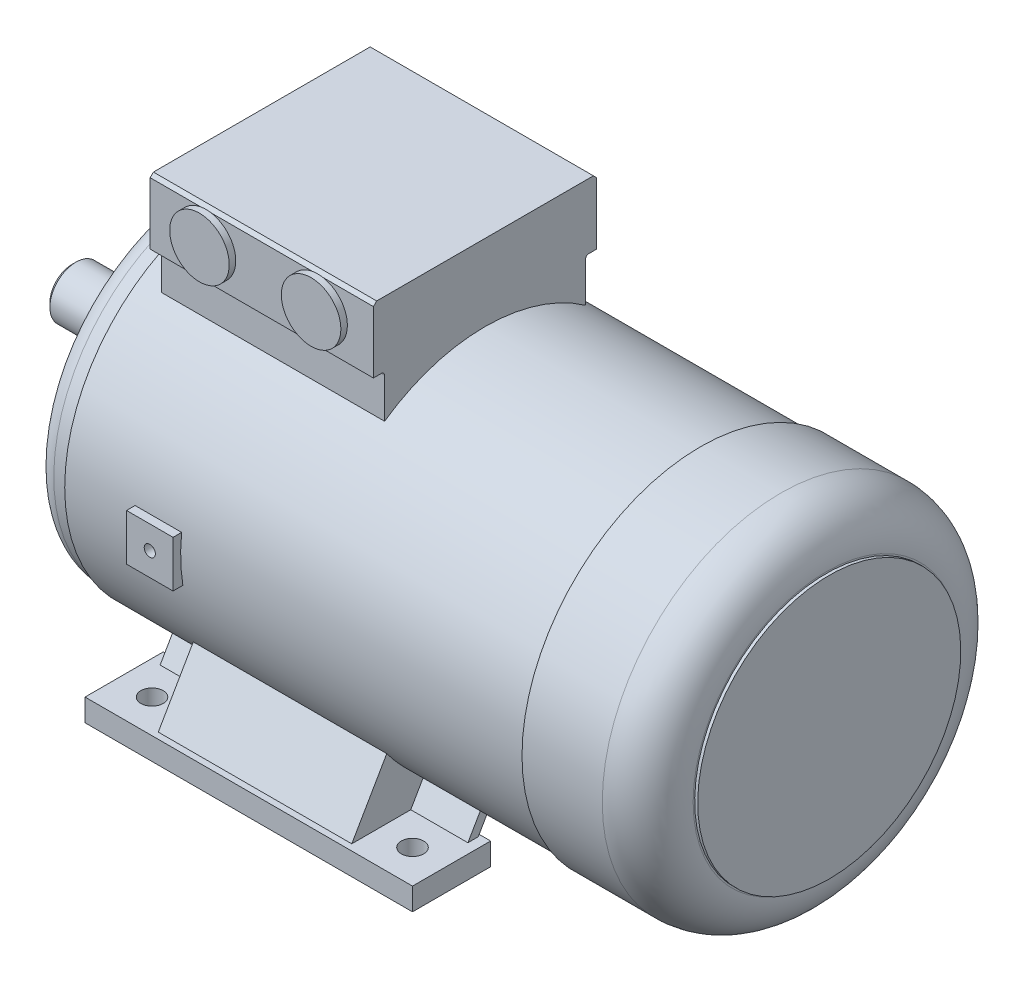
ISO-10303-21;
HEADER;
FILE_DESCRIPTION(('STEP AP214'),'2;1');
FILE_NAME('part.step','',(''),(''),'','','');
FILE_SCHEMA(('AUTOMOTIVE_DESIGN { 1 0 10303 214 1 1 1 1 }'));
ENDSEC;
DATA;
#1=APPLICATION_CONTEXT('core data for automotive mechanical design processes');
#2=APPLICATION_PROTOCOL_DEFINITION('international standard','automotive_design',2000,#1);
#3=PRODUCT_CONTEXT('',#1,'mechanical');
#4=PRODUCT('Part','Part','',(#3));
#5=PRODUCT_RELATED_PRODUCT_CATEGORY('part','',(#4));
#6=PRODUCT_DEFINITION_FORMATION('','',#4);
#7=PRODUCT_DEFINITION_CONTEXT('part definition',#1,'design');
#8=PRODUCT_DEFINITION('design','',#6,#7);
#9=PRODUCT_DEFINITION_SHAPE('','',#8);
#10=(LENGTH_UNIT() NAMED_UNIT(*) SI_UNIT(.MILLI.,.METRE.));
#11=(NAMED_UNIT(*) PLANE_ANGLE_UNIT() SI_UNIT($,.RADIAN.));
#12=(NAMED_UNIT(*) SI_UNIT($,.STERADIAN.) SOLID_ANGLE_UNIT());
#13=UNCERTAINTY_MEASURE_WITH_UNIT(LENGTH_MEASURE(1.E-05),#10,'distance_accuracy_value','');
#14=(GEOMETRIC_REPRESENTATION_CONTEXT(3) GLOBAL_UNCERTAINTY_ASSIGNED_CONTEXT((#13)) GLOBAL_UNIT_ASSIGNED_CONTEXT((#10,
#11,#12)) REPRESENTATION_CONTEXT('',''));
#15=CARTESIAN_POINT('',(0.,0.,0.));
#16=DIRECTION('',(0.,0.,1.));
#17=DIRECTION('',(1.,0.,0.));
#18=AXIS2_PLACEMENT_3D('',#15,#16,#17);
#19=CARTESIAN_POINT('',(0.,0.,0.));
#20=DIRECTION('',(-1.,0.,0.));
#21=DIRECTION('',(0.,-1.,0.));
#22=AXIS2_PLACEMENT_3D('',#19,#20,#21);
#23=PLANE('',#22);
#24=CARTESIAN_POINT('',(0.,0.,0.));
#25=DIRECTION('',(1.,0.,0.));
#26=DIRECTION('',(0.,1.,0.));
#27=AXIS2_PLACEMENT_3D('',#24,#25,#26);
#28=CIRCLE('',#27,11.8999999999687);
#29=CARTESIAN_POINT('',(0.,11.8999999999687,0.));
#30=VERTEX_POINT('',#29);
#31=EDGE_CURVE('E1295',#30,#30,#28,.T.);
#32=ORIENTED_EDGE('',*,*,#31,.F.);
#33=EDGE_LOOP('',(#32));
#34=FACE_BOUND('',#33,.T.);
#35=ADVANCED_FACE('F17',(#34),#23,.T.);
#36=CARTESIAN_POINT('',(2.0999999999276,0.,0.));
#37=DIRECTION('',(1.,0.,0.));
#38=DIRECTION('',(0.,1.,0.));
#39=AXIS2_PLACEMENT_3D('',#36,#37,#38);
#40=CONICAL_SURFACE('',#39,13.9999999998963,0.785398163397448);
#41=ORIENTED_EDGE('',*,*,#31,.T.);
#42=EDGE_LOOP('',(#41));
#43=FACE_BOUND('',#42,.T.);
#44=CARTESIAN_POINT('',(2.10000000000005,0.,0.));
#45=DIRECTION('',(-1.,0.,0.));
#46=DIRECTION('',(0.,-1.,0.));
#47=AXIS2_PLACEMENT_3D('',#44,#45,#46);
#48=CIRCLE('',#47,14.);
#49=CARTESIAN_POINT('',(2.10000000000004,-14.,0.));
#50=VERTEX_POINT('',#49);
#51=EDGE_CURVE('E1291',#50,#50,#48,.F.);
#52=ORIENTED_EDGE('',*,*,#51,.F.);
#53=EDGE_LOOP('',(#52));
#54=FACE_BOUND('',#53,.T.);
#55=ADVANCED_FACE('F1365',(#43,#54),#40,.T.);
#56=CARTESIAN_POINT('',(427.35,0.,0.));
#57=DIRECTION('',(-1.,0.,0.));
#58=DIRECTION('',(0.,-1.,0.));
#59=AXIS2_PLACEMENT_3D('',#56,#57,#58);
#60=CYLINDRICAL_SURFACE('',#59,14.);
#61=ORIENTED_EDGE('',*,*,#51,.T.);
#62=EDGE_LOOP('',(#61));
#63=FACE_BOUND('',#62,.T.);
#64=CARTESIAN_POINT('',(60.,0.,0.));
#65=DIRECTION('',(-1.,0.,0.));
#66=DIRECTION('',(0.,-1.,0.));
#67=AXIS2_PLACEMENT_3D('',#64,#65,#66);
#68=CIRCLE('',#67,14.);
#69=CARTESIAN_POINT('',(60.,-14.,0.));
#70=VERTEX_POINT('',#69);
#71=EDGE_CURVE('E1294',#70,#70,#68,.F.);
#72=ORIENTED_EDGE('',*,*,#71,.F.);
#73=EDGE_LOOP('',(#72));
#74=FACE_BOUND('',#73,.T.);
#75=ADVANCED_FACE('F1362',(#63,#74),#60,.T.);
#76=CARTESIAN_POINT('',(60.,0.,0.));
#77=DIRECTION('',(-1.,0.,0.));
#78=DIRECTION('',(0.,-1.,0.));
#79=AXIS2_PLACEMENT_3D('',#76,#77,#78);
#80=PLANE('',#79);
#81=ORIENTED_EDGE('',*,*,#71,.T.);
#82=EDGE_LOOP('',(#81));
#83=FACE_BOUND('',#82,.T.);
#84=CARTESIAN_POINT('',(60.,0.,0.));
#85=DIRECTION('',(-1.,0.,0.));
#86=DIRECTION('',(0.,-1.,0.));
#87=AXIS2_PLACEMENT_3D('',#84,#85,#86);
#88=CIRCLE('',#87,18.2);
#89=CARTESIAN_POINT('',(60.,-18.2,0.));
#90=VERTEX_POINT('',#89);
#91=EDGE_CURVE('E1307',#90,#90,#88,.F.);
#92=ORIENTED_EDGE('',*,*,#91,.F.);
#93=EDGE_LOOP('',(#92));
#94=FACE_BOUND('',#93,.T.);
#95=ADVANCED_FACE('F1358',(#83,#94),#80,.T.);
#96=CARTESIAN_POINT('',(427.35,0.,0.));
#97=DIRECTION('',(-1.,0.,0.));
#98=DIRECTION('',(0.,-1.,0.));
#99=AXIS2_PLACEMENT_3D('',#96,#97,#98);
#100=CYLINDRICAL_SURFACE('',#99,18.2);
#101=ORIENTED_EDGE('',*,*,#91,.T.);
#102=EDGE_LOOP('',(#101));
#103=FACE_BOUND('',#102,.T.);
#104=CARTESIAN_POINT('',(64.8,0.,0.));
#105=DIRECTION('',(-1.,0.,0.));
#106=DIRECTION('',(0.,-1.,0.));
#107=AXIS2_PLACEMENT_3D('',#104,#105,#106);
#108=CIRCLE('',#107,18.2);
#109=CARTESIAN_POINT('',(64.8,-18.2,0.));
#110=VERTEX_POINT('',#109);
#111=EDGE_CURVE('E1315',#110,#110,#108,.F.);
#112=ORIENTED_EDGE('',*,*,#111,.F.);
#113=EDGE_LOOP('',(#112));
#114=FACE_BOUND('',#113,.T.);
#115=ADVANCED_FACE('F1352',(#103,#114),#100,.T.);
#116=CARTESIAN_POINT('',(407.,0.,0.));
#117=DIRECTION('',(-1.,0.,0.));
#118=DIRECTION('',(0.,-1.,0.));
#119=AXIS2_PLACEMENT_3D('',#116,#117,#118);
#120=PLANE('',#119);
#121=CARTESIAN_POINT('',(407.,0.,0.));
#122=DIRECTION('',(-1.,0.,0.));
#123=DIRECTION('',(0.,-1.,0.));
#124=AXIS2_PLACEMENT_3D('',#121,#122,#123);
#125=CIRCLE('',#124,70.7000000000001);
#126=CARTESIAN_POINT('',(407.,-70.7000000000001,0.));
#127=VERTEX_POINT('',#126);
#128=EDGE_CURVE('E1318',#127,#127,#125,.T.);
#129=ORIENTED_EDGE('',*,*,#128,.F.);
#130=EDGE_LOOP('',(#129));
#131=FACE_BOUND('',#130,.T.);
#132=ADVANCED_FACE('F1346',(#131),#120,.F.);
#133=CARTESIAN_POINT('',(64.8,0.,0.));
#134=DIRECTION('',(-1.,0.,0.));
#135=DIRECTION('',(0.,-1.,0.));
#136=AXIS2_PLACEMENT_3D('',#133,#134,#135);
#137=PLANE('',#136);
#138=ORIENTED_EDGE('',*,*,#111,.T.);
#139=EDGE_LOOP('',(#138));
#140=FACE_BOUND('',#139,.T.);
#141=CARTESIAN_POINT('',(64.8,0.,0.));
#142=DIRECTION('',(-1.,0.,0.));
#143=DIRECTION('',(0.,-1.,0.));
#144=AXIS2_PLACEMENT_3D('',#141,#142,#143);
#145=CIRCLE('',#144,50.5);
#146=CARTESIAN_POINT('',(64.8,-50.5,0.));
#147=VERTEX_POINT('',#146);
#148=EDGE_CURVE('E1321',#147,#147,#145,.F.);
#149=ORIENTED_EDGE('',*,*,#148,.F.);
#150=EDGE_LOOP('',(#149));
#151=FACE_BOUND('',#150,.T.);
#152=ADVANCED_FACE('F1341',(#140,#151),#137,.T.);
#153=CARTESIAN_POINT('',(427.35,0.,0.));
#154=DIRECTION('',(-1.,0.,0.));
#155=DIRECTION('',(0.,-1.,0.));
#156=AXIS2_PLACEMENT_3D('',#153,#154,#155);
#157=CYLINDRICAL_SURFACE('',#156,70.7000000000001);
#158=CARTESIAN_POINT('',(405.372,0.,0.));
#159=DIRECTION('',(-1.,0.,0.));
#160=DIRECTION('',(0.,-1.,0.));
#161=AXIS2_PLACEMENT_3D('',#158,#159,#160);
#162=CIRCLE('',#161,70.7000000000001);
#163=CARTESIAN_POINT('',(405.372,-70.7000000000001,0.));
#164=VERTEX_POINT('',#163);
#165=EDGE_CURVE('E1324',#164,#164,#162,.F.);
#166=ORIENTED_EDGE('',*,*,#165,.T.);
#167=EDGE_LOOP('',(#166));
#168=FACE_BOUND('',#167,.T.);
#169=ORIENTED_EDGE('',*,*,#128,.T.);
#170=EDGE_LOOP('',(#169));
#171=FACE_BOUND('',#170,.T.);
#172=ADVANCED_FACE('F1336',(#168,#171),#157,.T.);
#173=CARTESIAN_POINT('',(427.35,0.,0.));
#174=DIRECTION('',(-1.,0.,0.));
#175=DIRECTION('',(0.,-1.,0.));
#176=AXIS2_PLACEMENT_3D('',#173,#174,#175);
#177=CYLINDRICAL_SURFACE('',#176,50.5);
#178=ORIENTED_EDGE('',*,*,#148,.T.);
#179=EDGE_LOOP('',(#178));
#180=FACE_BOUND('',#179,.T.);
#181=CARTESIAN_POINT('',(72.,0.,0.));
#182=DIRECTION('',(-1.,0.,0.));
#183=DIRECTION('',(0.,-1.,0.));
#184=AXIS2_PLACEMENT_3D('',#181,#182,#183);
#185=CIRCLE('',#184,50.5);
#186=CARTESIAN_POINT('',(72.,-50.5,0.));
#187=VERTEX_POINT('',#186);
#188=EDGE_CURVE('E862',#187,#187,#185,.F.);
#189=ORIENTED_EDGE('',*,*,#188,.F.);
#190=EDGE_LOOP('',(#189));
#191=FACE_BOUND('',#190,.T.);
#192=ADVANCED_FACE('F536',(#180,#191),#177,.T.);
#193=CARTESIAN_POINT('',(427.35,0.,0.));
#194=DIRECTION('',(-1.,0.,0.));
#195=DIRECTION('',(0.,-1.,0.));
#196=AXIS2_PLACEMENT_3D('',#193,#194,#195);
#197=CYLINDRICAL_SURFACE('',#196,93.93);
#198=CARTESIAN_POINT('',(136.8,-2.49999999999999,93.8967246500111));
#199=CARTESIAN_POINT('',(136.800006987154,-2.66845881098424,93.8922388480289));
#200=CARTESIAN_POINT('',(136.81424692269,-2.83713285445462,93.8872896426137));
#201=CARTESIAN_POINT('',(136.870868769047,-3.16991428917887,93.8766445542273));
#202=CARTESIAN_POINT('',(136.913310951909,-3.33401111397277,93.8709470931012));
#203=CARTESIAN_POINT('',(137.025123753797,-3.65261378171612,93.8590895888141));
#204=CARTESIAN_POINT('',(137.094471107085,-3.80712777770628,93.8529299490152));
#205=CARTESIAN_POINT('',(137.258089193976,-4.10223239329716,93.840494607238));
#206=CARTESIAN_POINT('',(137.352348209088,-4.24282951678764,93.8342189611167));
#207=CARTESIAN_POINT('',(137.563207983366,-4.50630187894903,93.821935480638));
#208=CARTESIAN_POINT('',(137.679823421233,-4.62916538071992,93.8159278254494));
#209=CARTESIAN_POINT('',(137.932067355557,-4.85357762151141,93.8045859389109));
#210=CARTESIAN_POINT('',(138.067697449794,-4.95512456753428,93.7992517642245));
#211=CARTESIAN_POINT('',(138.354051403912,-5.13395390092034,93.7896340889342));
#212=CARTESIAN_POINT('',(138.504767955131,-5.21124796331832,93.7853500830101));
#213=CARTESIAN_POINT('',(138.817070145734,-5.33942572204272,93.7781401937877));
#214=CARTESIAN_POINT('',(138.978655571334,-5.39030993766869,93.7752142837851));
#215=CARTESIAN_POINT('',(139.307860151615,-5.46415494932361,93.7709405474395));
#216=CARTESIAN_POINT('',(139.475470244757,-5.48715601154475,93.7695904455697));
#217=CARTESIAN_POINT('',(139.812178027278,-5.50470817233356,93.7685617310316));
#218=CARTESIAN_POINT('',(139.981275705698,-5.49925948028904,93.7688831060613));
#219=CARTESIAN_POINT('',(140.315973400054,-5.46008978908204,93.771171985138));
#220=CARTESIAN_POINT('',(140.481576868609,-5.42639818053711,93.773137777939));
#221=CARTESIAN_POINT('',(140.804773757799,-5.33174575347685,93.7785669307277));
#222=CARTESIAN_POINT('',(140.962367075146,-5.27078458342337,93.7820303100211));
#223=CARTESIAN_POINT('',(141.265165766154,-5.12329283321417,93.7902031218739));
#224=CARTESIAN_POINT('',(141.410364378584,-5.03674841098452,93.7949132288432));
#225=CARTESIAN_POINT('',(141.684167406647,-4.84057130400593,93.8052417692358));
#226=CARTESIAN_POINT('',(141.812773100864,-4.73094039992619,93.8108601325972));
#227=CARTESIAN_POINT('',(142.049934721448,-4.49153779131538,93.8226270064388));
#228=CARTESIAN_POINT('',(142.158464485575,-4.36174020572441,93.828776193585));
#229=CARTESIAN_POINT('',(142.352250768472,-4.08570460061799,93.8412008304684));
#230=CARTESIAN_POINT('',(142.437496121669,-3.93945874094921,93.8474763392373));
#231=CARTESIAN_POINT('',(142.582357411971,-3.63448528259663,93.8597823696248));
#232=CARTESIAN_POINT('',(142.641927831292,-3.47573610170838,93.8658124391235));
#233=CARTESIAN_POINT('',(142.733428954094,-3.15068768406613,93.8772835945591));
#234=CARTESIAN_POINT('',(142.765418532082,-2.98440533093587,93.8827259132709));
#235=CARTESIAN_POINT('',(142.788813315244,-2.76421256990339,93.8893329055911));
#236=CARTESIAN_POINT('',(142.793005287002,-2.71146491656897,93.8908709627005));
#237=CARTESIAN_POINT('',(142.798599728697,-2.60581939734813,93.8938624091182));
#238=CARTESIAN_POINT('',(142.800002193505,-2.55292153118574,93.8953157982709));
#239=CARTESIAN_POINT('',(142.799993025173,-2.33172203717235,93.9012044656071));
#240=CARTESIAN_POINT('',(142.785783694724,-2.16320479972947,93.9052339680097));
#241=CARTESIAN_POINT('',(142.729259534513,-1.83068192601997,93.9123063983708));
#242=CARTESIAN_POINT('',(142.686884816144,-1.66668668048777,93.9153472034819));
#243=CARTESIAN_POINT('',(142.575221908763,-1.34823208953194,93.9204583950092));
#244=CARTESIAN_POINT('',(142.50595578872,-1.19376504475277,93.922529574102));
#245=CARTESIAN_POINT('',(142.342508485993,-0.898723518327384,93.925816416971));
#246=CARTESIAN_POINT('',(142.248339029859,-0.758142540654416,93.927032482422));
#247=CARTESIAN_POINT('',(142.037736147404,-0.494765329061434,93.9287894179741));
#248=CARTESIAN_POINT('',(141.921301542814,-0.371970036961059,93.9293302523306));
#249=CARTESIAN_POINT('',(141.669464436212,-0.147651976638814,93.9299511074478));
#250=CARTESIAN_POINT('',(141.534060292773,-0.0461310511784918,93.9300310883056));
#251=CARTESIAN_POINT('',(141.248110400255,0.132759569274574,93.9299489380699));
#252=CARTESIAN_POINT('',(141.097562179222,0.210125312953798,93.9297867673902));
#253=CARTESIAN_POINT('',(140.785616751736,0.338486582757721,93.9294121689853));
#254=CARTESIAN_POINT('',(140.624219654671,0.389482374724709,93.9291997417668));
#255=CARTESIAN_POINT('',(140.295133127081,0.463662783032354,93.9288630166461));
#256=CARTESIAN_POINT('',(140.127442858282,0.486843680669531,93.9287387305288));
#257=CARTESIAN_POINT('',(139.790550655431,0.504723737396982,93.9286443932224));
#258=CARTESIAN_POINT('',(139.621348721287,0.499422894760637,93.9286743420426));
#259=CARTESIAN_POINT('',(139.286238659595,0.460490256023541,93.9288731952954));
#260=CARTESIAN_POINT('',(139.120330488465,0.426858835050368,93.929042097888));
#261=CARTESIAN_POINT('',(138.796513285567,0.332219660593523,93.9294243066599));
#262=CARTESIAN_POINT('',(138.63860434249,0.271211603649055,93.9296376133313));
#263=CARTESIAN_POINT('',(138.335262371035,0.123547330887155,93.9299476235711));
#264=CARTESIAN_POINT('',(138.189829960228,0.0368898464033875,93.9300443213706));
#265=CARTESIAN_POINT('',(137.915590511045,-0.159604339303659,93.9299155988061));
#266=CARTESIAN_POINT('',(137.786782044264,-0.269439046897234,93.9296902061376));
#267=CARTESIAN_POINT('',(137.549462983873,-0.509140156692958,93.9286963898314));
#268=CARTESIAN_POINT('',(137.440947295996,-0.639001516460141,93.9279281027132));
#269=CARTESIAN_POINT('',(137.247207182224,-0.915164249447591,93.9256429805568));
#270=CARTESIAN_POINT('',(137.161993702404,-1.06147330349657,93.9241257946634));
#271=CARTESIAN_POINT('',(137.017302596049,-1.36637362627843,93.9201851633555));
#272=CARTESIAN_POINT('',(136.957840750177,-1.52497235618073,93.9177611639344));
#273=CARTESIAN_POINT('',(136.866504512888,-1.84966224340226,93.9119261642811));
#274=CARTESIAN_POINT('',(136.834571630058,-2.01573672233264,93.9085172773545));
#275=CARTESIAN_POINT('',(136.811192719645,-2.23571504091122,93.9034040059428));
#276=CARTESIAN_POINT('',(136.806998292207,-2.28848051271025,93.9021328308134));
#277=CARTESIAN_POINT('',(136.801400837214,-2.39415690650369,93.8994979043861));
#278=CARTESIAN_POINT('',(136.799997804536,-2.44706782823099,93.898134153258));
#279=CARTESIAN_POINT('',(136.8,-2.49999999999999,93.8967246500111));
#280=B_SPLINE_CURVE_WITH_KNOTS('',3,(#198,#199,#200,#201,#202,#203,#204,#205,#206,#207,#208,
#209,#210,#211,#212,#213,#214,#215,#216,#217,#218,#219,#220,#221,#222,#223,#224,#225,#226,#227,
#228,#229,#230,#231,#232,#233,#234,#235,#236,#237,#238,#239,#240,#241,#242,#243,#244,#245,#246,
#247,#248,#249,#250,#251,#252,#253,#254,#255,#256,#257,#258,#259,#260,#261,#262,#263,#264,#265,
#266,#267,#268,#269,#270,#271,#272,#273,#274,#275,#276,#277,#278,#279),.UNSPECIFIED.,.T.,.F.,(4,
2,2,2,2,2,2,2,2,2,2,2,2,2,2,2,2,2,2,2,2,2,2,2,2,2,2,2,2,2,2,2,2,2,2,2,2,2,2,2,4),(0.,
0.505354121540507,1.01179174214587,1.51779240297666,2.02355546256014,2.52965173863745,
3.03579056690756,3.54168537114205,4.04757022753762,4.55272365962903,5.05787337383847,
5.56249806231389,6.06712925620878,6.57203398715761,7.07689978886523,7.58241894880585,
8.08818009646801,8.59483423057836,9.10040415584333,9.25916141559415,9.4179189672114,
9.92273046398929,10.4286187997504,10.9340928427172,11.4393292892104,11.9445924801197,
12.4498994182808,12.9552889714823,13.460673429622,13.9661254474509,14.4715774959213,
14.9770228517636,15.482473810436,15.9879497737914,16.4933822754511,16.9986877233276,
17.5042301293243,18.0100818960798,18.5148562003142,18.6736459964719,18.8324355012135),.UNSPECIFIED.);
#281=CARTESIAN_POINT('',(136.8,-2.49999999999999,93.8967246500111));
#282=VERTEX_POINT('',#281);
#283=EDGE_CURVE('E506',#282,#282,#280,.T.);
#284=ORIENTED_EDGE('',*,*,#283,.T.);
#285=EDGE_LOOP('',(#284));
#286=FACE_BOUND('',#285,.T.);
#287=ADVANCED_FACE('F528',(#286),#197,.T.);
#288=CARTESIAN_POINT('',(405.372,0.,0.));
#289=DIRECTION('',(-1.,0.,0.));
#290=DIRECTION('',(0.,-1.,0.));
#291=AXIS2_PLACEMENT_3D('',#288,#289,#290);
#292=PLANE('',#291);
#293=ORIENTED_EDGE('',*,*,#165,.F.);
#294=EDGE_LOOP('',(#293));
#295=FACE_BOUND('',#294,.T.);
#296=CARTESIAN_POINT('',(405.372,0.,0.));
#297=DIRECTION('',(-1.,0.,0.));
#298=DIRECTION('',(0.,1.,0.));
#299=AXIS2_PLACEMENT_3D('',#296,#297,#298);
#300=CIRCLE('',#299,71.5300000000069);
#301=CARTESIAN_POINT('',(405.372,71.5300000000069,0.));
#302=VERTEX_POINT('',#301);
#303=CARTESIAN_POINT('',(405.372,-71.5300000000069,0.));
#304=VERTEX_POINT('',#303);
#305=EDGE_CURVE('E497',#302,#304,#300,.T.);
#306=ORIENTED_EDGE('',*,*,#305,.F.);
#307=CARTESIAN_POINT('',(405.372,0.,0.));
#308=DIRECTION('',(-1.,0.,0.));
#309=DIRECTION('',(0.,-1.,0.));
#310=AXIS2_PLACEMENT_3D('',#307,#308,#309);
#311=CIRCLE('',#310,71.5300000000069);
#312=EDGE_CURVE('E501',#304,#302,#311,.T.);
#313=ORIENTED_EDGE('',*,*,#312,.F.);
#314=EDGE_LOOP('',(#306,#313));
#315=FACE_BOUND('',#314,.T.);
#316=ADVANCED_FACE('F508',(#295,#315),#292,.F.);
#317=CARTESIAN_POINT('',(72.,0.,0.));
#318=DIRECTION('',(-1.,0.,0.));
#319=DIRECTION('',(0.,-1.,0.));
#320=AXIS2_PLACEMENT_3D('',#317,#318,#319);
#321=PLANE('',#320);
#322=ORIENTED_EDGE('',*,*,#188,.T.);
#323=EDGE_LOOP('',(#322));
#324=FACE_BOUND('',#323,.T.);
#325=CARTESIAN_POINT('',(72.,0.,0.));
#326=DIRECTION('',(1.,0.,0.));
#327=DIRECTION('',(0.,-1.,0.));
#328=AXIS2_PLACEMENT_3D('',#325,#326,#327);
#329=CIRCLE('',#328,81.8099999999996);
#330=CARTESIAN_POINT('',(72.,-81.8099999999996,0.));
#331=VERTEX_POINT('',#330);
#332=CARTESIAN_POINT('',(72.,81.8099999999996,0.));
#333=VERTEX_POINT('',#332);
#334=EDGE_CURVE('E203',#331,#333,#329,.T.);
#335=ORIENTED_EDGE('',*,*,#334,.F.);
#336=CARTESIAN_POINT('',(72.,0.,0.));
#337=DIRECTION('',(1.,0.,0.));
#338=DIRECTION('',(0.,1.,0.));
#339=AXIS2_PLACEMENT_3D('',#336,#337,#338);
#340=CIRCLE('',#339,81.8099999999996);
#341=EDGE_CURVE('E509',#333,#331,#340,.T.);
#342=ORIENTED_EDGE('',*,*,#341,.F.);
#343=EDGE_LOOP('',(#335,#342));
#344=FACE_BOUND('',#343,.T.);
#345=ADVANCED_FACE('F527',(#324,#344),#321,.T.);
#346=CARTESIAN_POINT('',(105.,-100.,98.));
#347=DIRECTION('',(0.,-1.,0.));
#348=DIRECTION('',(0.,0.,-1.));
#349=AXIS2_PLACEMENT_3D('',#346,#347,#348);
#350=PLANE('',#349);
#351=CARTESIAN_POINT('',(263.,-100.,80.));
#352=DIRECTION('',(0.,1.,0.));
#353=DIRECTION('',(0.,0.,1.));
#354=AXIS2_PLACEMENT_3D('',#351,#352,#353);
#355=CIRCLE('',#354,6.);
#356=CARTESIAN_POINT('',(263.,-100.,86.));
#357=VERTEX_POINT('',#356);
#358=EDGE_CURVE('E545',#357,#357,#355,.T.);
#359=ORIENTED_EDGE('',*,*,#358,.T.);
#360=EDGE_LOOP('',(#359));
#361=FACE_BOUND('',#360,.T.);
#362=CARTESIAN_POINT('',(123.,-100.,80.));
#363=DIRECTION('',(0.,1.,0.));
#364=DIRECTION('',(0.,0.,1.));
#365=AXIS2_PLACEMENT_3D('',#362,#363,#364);
#366=CIRCLE('',#365,6.);
#367=CARTESIAN_POINT('',(123.,-100.,86.));
#368=VERTEX_POINT('',#367);
#369=EDGE_CURVE('E870',#368,#368,#366,.T.);
#370=ORIENTED_EDGE('',*,*,#369,.T.);
#371=EDGE_LOOP('',(#370));
#372=FACE_BOUND('',#371,.T.);
#373=DIRECTION('',(1.,0.,0.));
#374=VECTOR('',#373,1.);
#375=CARTESIAN_POINT('',(105.,-100.,98.));
#376=LINE('',#375,#374);
#377=CARTESIAN_POINT('',(105.,-100.,98.));
#378=VERTEX_POINT('',#377);
#379=CARTESIAN_POINT('',(281.,-100.,98.));
#380=VERTEX_POINT('',#379);
#381=EDGE_CURVE('E861',#378,#380,#376,.T.);
#382=ORIENTED_EDGE('',*,*,#381,.F.);
#383=DIRECTION('',(0.,0.,-1.));
#384=VECTOR('',#383,1.);
#385=CARTESIAN_POINT('',(105.,-100.,0.));
#386=LINE('',#385,#384);
#387=CARTESIAN_POINT('',(105.,-100.,56.));
#388=VERTEX_POINT('',#387);
#389=EDGE_CURVE('E858',#378,#388,#386,.T.);
#390=ORIENTED_EDGE('',*,*,#389,.T.);
#391=DIRECTION('',(-1.,0.,0.));
#392=VECTOR('',#391,1.);
#393=CARTESIAN_POINT('',(105.,-100.,56.));
#394=LINE('',#393,#392);
#395=CARTESIAN_POINT('',(281.,-100.,56.));
#396=VERTEX_POINT('',#395);
#397=EDGE_CURVE('E843',#396,#388,#394,.T.);
#398=ORIENTED_EDGE('',*,*,#397,.F.);
#399=DIRECTION('',(0.,0.,-1.));
#400=VECTOR('',#399,1.);
#401=CARTESIAN_POINT('',(281.,-100.,0.));
#402=LINE('',#401,#400);
#403=EDGE_CURVE('E867',#380,#396,#402,.T.);
#404=ORIENTED_EDGE('',*,*,#403,.F.);
#405=EDGE_LOOP('',(#382,#390,#398,#404));
#406=FACE_BOUND('',#405,.T.);
#407=ADVANCED_FACE('F574',(#361,#372,#406),#350,.T.);
#408=CARTESIAN_POINT('',(105.,0.,0.));
#409=DIRECTION('',(1.,0.,0.));
#410=DIRECTION('',(0.,0.,-1.));
#411=AXIS2_PLACEMENT_3D('',#408,#409,#410);
#412=PLANE('',#411);
#413=DIRECTION('',(0.,0.,1.));
#414=VECTOR('',#413,1.);
#415=CARTESIAN_POINT('',(105.,-88.,56.));
#416=LINE('',#415,#414);
#417=CARTESIAN_POINT('',(105.,-88.,56.));
#418=VERTEX_POINT('',#417);
#419=CARTESIAN_POINT('',(105.,-88.,98.));
#420=VERTEX_POINT('',#419);
#421=EDGE_CURVE('E938',#418,#420,#416,.T.);
#422=ORIENTED_EDGE('',*,*,#421,.F.);
#423=DIRECTION('',(0.,1.,0.));
#424=VECTOR('',#423,1.);
#425=CARTESIAN_POINT('',(105.,-100.,56.));
#426=LINE('',#425,#424);
#427=EDGE_CURVE('E840',#388,#418,#426,.T.);
#428=ORIENTED_EDGE('',*,*,#427,.F.);
#429=ORIENTED_EDGE('',*,*,#389,.F.);
#430=DIRECTION('',(0.,1.,0.));
#431=VECTOR('',#430,1.);
#432=CARTESIAN_POINT('',(105.,-88.,98.));
#433=LINE('',#432,#431);
#434=EDGE_CURVE('E924',#420,#378,#433,.F.);
#435=ORIENTED_EDGE('',*,*,#434,.F.);
#436=EDGE_LOOP('',(#422,#428,#429,#435));
#437=FACE_BOUND('',#436,.T.);
#438=ADVANCED_FACE('F571',(#437),#412,.F.);
#439=CARTESIAN_POINT('',(105.,-88.,98.));
#440=DIRECTION('',(0.,0.,1.));
#441=DIRECTION('',(1.,0.,0.));
#442=AXIS2_PLACEMENT_3D('',#439,#440,#441);
#443=PLANE('',#442);
#444=DIRECTION('',(1.,0.,0.));
#445=VECTOR('',#444,1.);
#446=CARTESIAN_POINT('',(105.,-88.,98.));
#447=LINE('',#446,#445);
#448=CARTESIAN_POINT('',(281.,-88.,98.));
#449=VERTEX_POINT('',#448);
#450=EDGE_CURVE('E928',#420,#449,#447,.T.);
#451=ORIENTED_EDGE('',*,*,#450,.F.);
#452=ORIENTED_EDGE('',*,*,#434,.T.);
#453=ORIENTED_EDGE('',*,*,#381,.T.);
#454=DIRECTION('',(0.,1.,0.));
#455=VECTOR('',#454,1.);
#456=CARTESIAN_POINT('',(281.,0.,98.));
#457=LINE('',#456,#455);
#458=EDGE_CURVE('E871',#449,#380,#457,.F.);
#459=ORIENTED_EDGE('',*,*,#458,.F.);
#460=EDGE_LOOP('',(#451,#452,#453,#459));
#461=FACE_BOUND('',#460,.T.);
#462=ADVANCED_FACE('F567',(#461),#443,.T.);
#463=CARTESIAN_POINT('',(281.,0.,0.));
#464=DIRECTION('',(1.,0.,0.));
#465=DIRECTION('',(0.,0.,-1.));
#466=AXIS2_PLACEMENT_3D('',#463,#464,#465);
#467=PLANE('',#466);
#468=ORIENTED_EDGE('',*,*,#458,.T.);
#469=ORIENTED_EDGE('',*,*,#403,.T.);
#470=DIRECTION('',(0.,1.,0.));
#471=VECTOR('',#470,1.);
#472=CARTESIAN_POINT('',(281.,-100.,56.));
#473=LINE('',#472,#471);
#474=CARTESIAN_POINT('',(281.,-88.,56.));
#475=VERTEX_POINT('',#474);
#476=EDGE_CURVE('E202',#475,#396,#473,.F.);
#477=ORIENTED_EDGE('',*,*,#476,.F.);
#478=DIRECTION('',(0.,0.,1.));
#479=VECTOR('',#478,1.);
#480=CARTESIAN_POINT('',(281.,-88.,56.));
#481=LINE('',#480,#479);
#482=EDGE_CURVE('E1027',#449,#475,#481,.F.);
#483=ORIENTED_EDGE('',*,*,#482,.F.);
#484=EDGE_LOOP('',(#468,#469,#477,#483));
#485=FACE_BOUND('',#484,.T.);
#486=ADVANCED_FACE('F563',(#485),#467,.T.);
#487=CARTESIAN_POINT('',(123.,-100.,80.));
#488=DIRECTION('',(0.,1.,0.));
#489=DIRECTION('',(0.,0.,1.));
#490=AXIS2_PLACEMENT_3D('',#487,#488,#489);
#491=CYLINDRICAL_SURFACE('',#490,6.);
#492=CARTESIAN_POINT('',(123.,-88.,80.));
#493=DIRECTION('',(0.,1.,0.));
#494=DIRECTION('',(0.,0.,1.));
#495=AXIS2_PLACEMENT_3D('',#492,#493,#494);
#496=CIRCLE('',#495,6.);
#497=CARTESIAN_POINT('',(123.,-88.,86.));
#498=VERTEX_POINT('',#497);
#499=EDGE_CURVE('E435',#498,#498,#496,.F.);
#500=ORIENTED_EDGE('',*,*,#499,.F.);
#501=EDGE_LOOP('',(#500));
#502=FACE_BOUND('',#501,.T.);
#503=ORIENTED_EDGE('',*,*,#369,.F.);
#504=EDGE_LOOP('',(#503));
#505=FACE_BOUND('',#504,.T.);
#506=ADVANCED_FACE('F559',(#502,#505),#491,.F.);
#507=CARTESIAN_POINT('',(263.,-100.,80.));
#508=DIRECTION('',(0.,1.,0.));
#509=DIRECTION('',(0.,0.,1.));
#510=AXIS2_PLACEMENT_3D('',#507,#508,#509);
#511=CYLINDRICAL_SURFACE('',#510,6.);
#512=CARTESIAN_POINT('',(263.,-88.,80.));
#513=DIRECTION('',(0.,1.,0.));
#514=DIRECTION('',(0.,0.,1.));
#515=AXIS2_PLACEMENT_3D('',#512,#513,#514);
#516=CIRCLE('',#515,6.);
#517=CARTESIAN_POINT('',(263.,-88.,86.));
#518=VERTEX_POINT('',#517);
#519=EDGE_CURVE('E836',#518,#518,#516,.F.);
#520=ORIENTED_EDGE('',*,*,#519,.F.);
#521=EDGE_LOOP('',(#520));
#522=FACE_BOUND('',#521,.T.);
#523=ORIENTED_EDGE('',*,*,#358,.F.);
#524=EDGE_LOOP('',(#523));
#525=FACE_BOUND('',#524,.T.);
#526=ADVANCED_FACE('F554',(#522,#525),#511,.F.);
#527=CARTESIAN_POINT('',(139.8,-2.5,0.));
#528=DIRECTION('',(0.,0.,1.));
#529=DIRECTION('',(1.,0.,0.));
#530=AXIS2_PLACEMENT_3D('',#527,#528,#529);
#531=CYLINDRICAL_SURFACE('',#530,3.);
#532=CARTESIAN_POINT('',(139.8,-2.5,98.));
#533=DIRECTION('',(0.,0.,1.));
#534=DIRECTION('',(1.,0.,0.));
#535=AXIS2_PLACEMENT_3D('',#532,#533,#534);
#536=CIRCLE('',#535,3.);
#537=CARTESIAN_POINT('',(142.8,-2.5,98.));
#538=VERTEX_POINT('',#537);
#539=EDGE_CURVE('E833',#538,#538,#536,.F.);
#540=ORIENTED_EDGE('',*,*,#539,.F.);
#541=EDGE_LOOP('',(#540));
#542=FACE_BOUND('',#541,.T.);
#543=ORIENTED_EDGE('',*,*,#283,.F.);
#544=EDGE_LOOP('',(#543));
#545=FACE_BOUND('',#544,.T.);
#546=ADVANCED_FACE('F548',(#542,#545),#531,.F.);
#547=CARTESIAN_POINT('',(102.,100.,63.5));
#548=DIRECTION('',(0.,0.,1.));
#549=DIRECTION('',(1.,0.,0.));
#550=AXIS2_PLACEMENT_3D('',#547,#548,#549);
#551=PLANE('',#550);
#552=CARTESIAN_POINT('',(132.,117.5,63.5));
#553=DIRECTION('',(0.,0.,1.));
#554=DIRECTION('',(1.,0.,0.));
#555=AXIS2_PLACEMENT_3D('',#552,#553,#554);
#556=CIRCLE('',#555,16.);
#557=CARTESIAN_POINT('',(148.,117.5,63.5));
#558=VERTEX_POINT('',#557);
#559=EDGE_CURVE('E825',#558,#558,#556,.F.);
#560=ORIENTED_EDGE('',*,*,#559,.F.);
#561=EDGE_LOOP('',(#560));
#562=FACE_BOUND('',#561,.T.);
#563=ADVANCED_FACE('F553',(#562),#551,.T.);
#564=CARTESIAN_POINT('',(102.,100.,63.5));
#565=DIRECTION('',(0.,0.,1.));
#566=DIRECTION('',(1.,0.,0.));
#567=AXIS2_PLACEMENT_3D('',#564,#565,#566);
#568=PLANE('',#567);
#569=CARTESIAN_POINT('',(192.,117.5,63.5));
#570=DIRECTION('',(0.,0.,1.));
#571=DIRECTION('',(1.,0.,0.));
#572=AXIS2_PLACEMENT_3D('',#569,#570,#571);
#573=CIRCLE('',#572,16.);
#574=CARTESIAN_POINT('',(208.,117.5,63.5));
#575=VERTEX_POINT('',#574);
#576=EDGE_CURVE('E346',#575,#575,#573,.F.);
#577=ORIENTED_EDGE('',*,*,#576,.F.);
#578=EDGE_LOOP('',(#577));
#579=FACE_BOUND('',#578,.T.);
#580=ADVANCED_FACE('F811',(#579),#568,.T.);
#581=CARTESIAN_POINT('',(427.35,0.,0.));
#582=DIRECTION('',(-1.,0.,0.));
#583=DIRECTION('',(0.,-1.,0.));
#584=AXIS2_PLACEMENT_3D('',#581,#582,#583);
#585=CYLINDRICAL_SURFACE('',#584,93.93);
#586=CARTESIAN_POINT('',(136.8,-2.49999999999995,-93.8967246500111));
#587=CARTESIAN_POINT('',(136.800006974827,-2.33172203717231,-93.9012044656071));
#588=CARTESIAN_POINT('',(136.814216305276,-2.16320479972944,-93.9052339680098));
#589=CARTESIAN_POINT('',(136.870740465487,-1.83068192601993,-93.9123063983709));
#590=CARTESIAN_POINT('',(136.913115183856,-1.66668668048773,-93.9153472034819));
#591=CARTESIAN_POINT('',(137.024778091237,-1.34823208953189,-93.9204583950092));
#592=CARTESIAN_POINT('',(137.09404421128,-1.19376504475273,-93.922529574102));
#593=CARTESIAN_POINT('',(137.257491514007,-0.898723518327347,-93.925816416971));
#594=CARTESIAN_POINT('',(137.351660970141,-0.758142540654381,-93.927032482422));
#595=CARTESIAN_POINT('',(137.562263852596,-0.494765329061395,-93.9287894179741));
#596=CARTESIAN_POINT('',(137.678698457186,-0.371970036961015,-93.9293302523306));
#597=CARTESIAN_POINT('',(137.930535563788,-0.147651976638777,-93.9299511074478));
#598=CARTESIAN_POINT('',(138.065939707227,-0.046131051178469,-93.9300310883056));
#599=CARTESIAN_POINT('',(138.351889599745,0.132759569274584,-93.9299489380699));
#600=CARTESIAN_POINT('',(138.502437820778,0.210125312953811,-93.9297867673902));
#601=CARTESIAN_POINT('',(138.814383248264,0.338486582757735,-93.9294121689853));
#602=CARTESIAN_POINT('',(138.975780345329,0.389482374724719,-93.9291997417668));
#603=CARTESIAN_POINT('',(139.304866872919,0.463662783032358,-93.9288630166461));
#604=CARTESIAN_POINT('',(139.472557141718,0.486843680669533,-93.9287387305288));
#605=CARTESIAN_POINT('',(139.809449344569,0.504723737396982,-93.9286443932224));
#606=CARTESIAN_POINT('',(139.978651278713,0.499422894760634,-93.9286743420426));
#607=CARTESIAN_POINT('',(140.313761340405,0.460490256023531,-93.9288731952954));
#608=CARTESIAN_POINT('',(140.479669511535,0.426858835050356,-93.929042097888));
#609=CARTESIAN_POINT('',(140.803486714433,0.332219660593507,-93.9294243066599));
#610=CARTESIAN_POINT('',(140.961395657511,0.271211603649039,-93.9296376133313));
#611=CARTESIAN_POINT('',(141.264737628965,0.123547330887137,-93.9299476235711));
#612=CARTESIAN_POINT('',(141.410170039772,0.0368898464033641,-93.9300443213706));
#613=CARTESIAN_POINT('',(141.684409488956,-0.159604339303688,-93.9299155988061));
#614=CARTESIAN_POINT('',(141.813217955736,-0.26943904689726,-93.9296902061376));
#615=CARTESIAN_POINT('',(142.050537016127,-0.509140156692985,-93.9286963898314));
#616=CARTESIAN_POINT('',(142.159052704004,-0.639001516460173,-93.9279281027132));
#617=CARTESIAN_POINT('',(142.352792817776,-0.915164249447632,-93.9256429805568));
#618=CARTESIAN_POINT('',(142.438006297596,-1.06147330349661,-93.9241257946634));
#619=CARTESIAN_POINT('',(142.582697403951,-1.36637362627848,-93.9201851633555));
#620=CARTESIAN_POINT('',(142.642159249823,-1.52497235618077,-93.9177611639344));
#621=CARTESIAN_POINT('',(142.733495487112,-1.84966224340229,-93.9119261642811));
#622=CARTESIAN_POINT('',(142.765428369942,-2.01573672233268,-93.9085172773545));
#623=CARTESIAN_POINT('',(142.788807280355,-2.23571504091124,-93.9034040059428));
#624=CARTESIAN_POINT('',(142.793001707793,-2.28848051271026,-93.9021328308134));
#625=CARTESIAN_POINT('',(142.798599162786,-2.39415690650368,-93.8994979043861));
#626=CARTESIAN_POINT('',(142.800002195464,-2.44706782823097,-93.898134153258));
#627=CARTESIAN_POINT('',(142.799993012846,-2.6684588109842,-93.8922388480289));
#628=CARTESIAN_POINT('',(142.78575307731,-2.83713285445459,-93.8872896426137));
#629=CARTESIAN_POINT('',(142.729131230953,-3.16991428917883,-93.8766445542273));
#630=CARTESIAN_POINT('',(142.686689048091,-3.33401111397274,-93.8709470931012));
#631=CARTESIAN_POINT('',(142.574876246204,-3.65261378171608,-93.8590895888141));
#632=CARTESIAN_POINT('',(142.505528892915,-3.80712777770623,-93.8529299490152));
#633=CARTESIAN_POINT('',(142.341910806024,-4.10223239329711,-93.840494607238));
#634=CARTESIAN_POINT('',(142.247651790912,-4.2428295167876,-93.8342189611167));
#635=CARTESIAN_POINT('',(142.036792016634,-4.506301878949,-93.821935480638));
#636=CARTESIAN_POINT('',(141.920176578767,-4.6291653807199,-93.8159278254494));
#637=CARTESIAN_POINT('',(141.667932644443,-4.85357762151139,-93.8045859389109));
#638=CARTESIAN_POINT('',(141.532302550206,-4.95512456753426,-93.7992517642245));
#639=CARTESIAN_POINT('',(141.245948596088,-5.13395390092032,-93.7896340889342));
#640=CARTESIAN_POINT('',(141.095232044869,-5.2112479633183,-93.7853500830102));
#641=CARTESIAN_POINT('',(140.782929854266,-5.3394257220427,-93.7781401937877));
#642=CARTESIAN_POINT('',(140.621344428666,-5.39030993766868,-93.7752142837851));
#643=CARTESIAN_POINT('',(140.292139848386,-5.4641549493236,-93.7709405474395));
#644=CARTESIAN_POINT('',(140.124529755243,-5.48715601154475,-93.7695904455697));
#645=CARTESIAN_POINT('',(139.787821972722,-5.50470817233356,-93.7685617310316));
#646=CARTESIAN_POINT('',(139.618724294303,-5.49925948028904,-93.7688831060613));
#647=CARTESIAN_POINT('',(139.284026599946,-5.46008978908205,-93.771171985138));
#648=CARTESIAN_POINT('',(139.118423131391,-5.42639818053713,-93.773137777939));
#649=CARTESIAN_POINT('',(138.795226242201,-5.33174575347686,-93.7785669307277));
#650=CARTESIAN_POINT('',(138.637632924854,-5.27078458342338,-93.7820303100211));
#651=CARTESIAN_POINT('',(138.334834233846,-5.12329283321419,-93.7902031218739));
#652=CARTESIAN_POINT('',(138.189635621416,-5.03674841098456,-93.7949132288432));
#653=CARTESIAN_POINT('',(137.915832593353,-4.84057130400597,-93.8052417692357));
#654=CARTESIAN_POINT('',(137.787226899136,-4.73094039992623,-93.8108601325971));
#655=CARTESIAN_POINT('',(137.550065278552,-4.49153779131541,-93.8226270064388));
#656=CARTESIAN_POINT('',(137.441535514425,-4.36174020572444,-93.828776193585));
#657=CARTESIAN_POINT('',(137.247749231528,-4.08570460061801,-93.8412008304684));
#658=CARTESIAN_POINT('',(137.162503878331,-3.93945874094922,-93.8474763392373));
#659=CARTESIAN_POINT('',(137.017642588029,-3.63448528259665,-93.8597823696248));
#660=CARTESIAN_POINT('',(136.958072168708,-3.47573610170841,-93.8658124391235));
#661=CARTESIAN_POINT('',(136.866571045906,-3.15068768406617,-93.8772835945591));
#662=CARTESIAN_POINT('',(136.834581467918,-2.98440533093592,-93.8827259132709));
#663=CARTESIAN_POINT('',(136.811186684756,-2.76421256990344,-93.8893329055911));
#664=CARTESIAN_POINT('',(136.806994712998,-2.711464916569,-93.8908709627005));
#665=CARTESIAN_POINT('',(136.801400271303,-2.60581939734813,-93.8938624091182));
#666=CARTESIAN_POINT('',(136.799997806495,-2.55292153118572,-93.8953157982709));
#667=CARTESIAN_POINT('',(136.8,-2.49999999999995,-93.8967246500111));
#668=B_SPLINE_CURVE_WITH_KNOTS('',3,(#586,#587,#588,#589,#590,#591,#592,#593,#594,#595,#596,
#597,#598,#599,#600,#601,#602,#603,#604,#605,#606,#607,#608,#609,#610,#611,#612,#613,#614,#615,
#616,#617,#618,#619,#620,#621,#622,#623,#624,#625,#626,#627,#628,#629,#630,#631,#632,#633,#634,
#635,#636,#637,#638,#639,#640,#641,#642,#643,#644,#645,#646,#647,#648,#649,#650,#651,#652,#653,
#654,#655,#656,#657,#658,#659,#660,#661,#662,#663,#664,#665,#666,#667),.UNSPECIFIED.,.T.,.F.,(4,
2,2,2,2,2,2,2,2,2,2,2,2,2,2,2,2,2,2,2,2,2,2,2,2,2,2,2,2,2,2,2,2,2,2,2,2,2,2,2,4),(0.,
0.504811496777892,1.01069983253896,1.51617387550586,2.02141032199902,2.52667351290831,
3.03198045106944,3.53737000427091,4.04275446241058,4.54820648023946,5.05365852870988,
5.55910388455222,6.06455484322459,6.57003080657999,7.07546330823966,7.5807687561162,
8.08631116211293,8.5921629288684,9.09693723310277,9.25572702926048,9.41451653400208,
9.91987065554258,10.4263082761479,10.9323089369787,11.4380719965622,11.9441682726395,
12.4503071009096,12.9562019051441,13.4620867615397,13.9672401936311,14.4723899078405,
14.9770145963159,15.4816457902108,15.9865505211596,16.4914163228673,16.9969354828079,
17.5026966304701,18.0093507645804,18.5149206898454,18.6736779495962,18.8324355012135),.UNSPECIFIED.);
#669=CARTESIAN_POINT('',(136.8,-2.49999999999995,-93.8967246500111));
#670=VERTEX_POINT('',#669);
#671=EDGE_CURVE('E798',#670,#670,#668,.T.);
#672=ORIENTED_EDGE('',*,*,#671,.T.);
#673=EDGE_LOOP('',(#672));
#674=FACE_BOUND('',#673,.T.);
#675=ADVANCED_FACE('F808',(#674),#585,.T.);
#676=CARTESIAN_POINT('',(380.952000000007,0.,0.));
#677=DIRECTION('',(-1.,0.,0.));
#678=DIRECTION('',(0.,1.,0.));
#679=AXIS2_PLACEMENT_3D('',#676,#677,#678);
#680=TOROIDAL_SURFACE('',#679,71.5300000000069,24.4199999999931);
#681=ORIENTED_EDGE('',*,*,#305,.T.);
#682=ORIENTED_EDGE('',*,*,#312,.T.);
#683=EDGE_LOOP('',(#681,#682));
#684=FACE_BOUND('',#683,.T.);
#685=CARTESIAN_POINT('',(380.952000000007,0.,0.));
#686=DIRECTION('',(-1.,0.,0.));
#687=DIRECTION('',(0.,-1.,0.));
#688=AXIS2_PLACEMENT_3D('',#685,#686,#687);
#689=CIRCLE('',#688,95.95);
#690=CARTESIAN_POINT('',(380.952000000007,-95.9500000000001,0.));
#691=VERTEX_POINT('',#690);
#692=EDGE_CURVE('E461',#691,#691,#689,.T.);
#693=ORIENTED_EDGE('',*,*,#692,.F.);
#694=EDGE_LOOP('',(#693));
#695=FACE_BOUND('',#694,.T.);
#696=ADVANCED_FACE('F470',(#684,#695),#680,.T.);
#697=CARTESIAN_POINT('',(82.1000000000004,0.,0.));
#698=DIRECTION('',(-1.,0.,0.));
#699=DIRECTION('',(0.,1.,0.));
#700=AXIS2_PLACEMENT_3D('',#697,#698,#699);
#701=TOROIDAL_SURFACE('',#700,81.8099999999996,10.1000000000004);
#702=ORIENTED_EDGE('',*,*,#341,.T.);
#703=ORIENTED_EDGE('',*,*,#334,.T.);
#704=EDGE_LOOP('',(#702,#703));
#705=FACE_BOUND('',#704,.T.);
#706=CARTESIAN_POINT('',(82.1000000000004,0.,0.));
#707=DIRECTION('',(-1.,0.,0.));
#708=DIRECTION('',(0.,-1.,0.));
#709=AXIS2_PLACEMENT_3D('',#706,#707,#708);
#710=CIRCLE('',#709,91.91);
#711=CARTESIAN_POINT('',(82.1000000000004,-91.91,0.));
#712=VERTEX_POINT('',#711);
#713=EDGE_CURVE('E392',#712,#712,#710,.F.);
#714=ORIENTED_EDGE('',*,*,#713,.F.);
#715=EDGE_LOOP('',(#714));
#716=FACE_BOUND('',#715,.T.);
#717=ADVANCED_FACE('F466',(#705,#716),#701,.T.);
#718=CARTESIAN_POINT('',(245.,0.,0.));
#719=DIRECTION('',(1.,0.,0.));
#720=DIRECTION('',(0.,0.,-1.));
#721=AXIS2_PLACEMENT_3D('',#718,#719,#720);
#722=PLANE('',#721);
#723=CARTESIAN_POINT('',(245.,0.,0.));
#724=DIRECTION('',(-1.,0.,0.));
#725=DIRECTION('',(0.,-1.,0.));
#726=AXIS2_PLACEMENT_3D('',#723,#724,#725);
#727=CIRCLE('',#726,93.93);
#728=CARTESIAN_POINT('',(245.,-79.0037567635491,50.8060165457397));
#729=VERTEX_POINT('',#728);
#730=CARTESIAN_POINT('',(245.,-78.3472750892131,51.8126373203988));
#731=VERTEX_POINT('',#730);
#732=EDGE_CURVE('E189',#729,#731,#727,.T.);
#733=ORIENTED_EDGE('',*,*,#732,.T.);
#734=DIRECTION('',(0.,0.866025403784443,-0.499999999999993));
#735=VECTOR('',#734,1.);
#736=CARTESIAN_POINT('',(245.,-93.,60.272391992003));
#737=LINE('',#736,#735);
#738=CARTESIAN_POINT('',(245.,-88.,57.3856406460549));
#739=VERTEX_POINT('',#738);
#740=EDGE_CURVE('E197',#739,#731,#737,.T.);
#741=ORIENTED_EDGE('',*,*,#740,.F.);
#742=DIRECTION('',(0.,0.,1.));
#743=VECTOR('',#742,1.);
#744=CARTESIAN_POINT('',(245.,-88.,56.));
#745=LINE('',#744,#743);
#746=CARTESIAN_POINT('',(245.,-88.,56.));
#747=VERTEX_POINT('',#746);
#748=EDGE_CURVE('E432',#747,#739,#745,.T.);
#749=ORIENTED_EDGE('',*,*,#748,.F.);
#750=DIRECTION('',(0.,0.866025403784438,-0.500000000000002));
#751=VECTOR('',#750,1.);
#752=CARTESIAN_POINT('',(245.,-88.,56.));
#753=LINE('',#752,#751);
#754=EDGE_CURVE('E200',#729,#747,#753,.F.);
#755=ORIENTED_EDGE('',*,*,#754,.F.);
#756=EDGE_LOOP('',(#733,#741,#749,#755));
#757=FACE_BOUND('',#756,.T.);
#758=ADVANCED_FACE('F194',(#757),#722,.T.);
#759=CARTESIAN_POINT('',(105.,-100.,56.));
#760=DIRECTION('',(0.,0.,-1.));
#761=DIRECTION('',(-1.,0.,0.));
#762=AXIS2_PLACEMENT_3D('',#759,#760,#761);
#763=PLANE('',#762);
#764=DIRECTION('',(1.,0.,0.));
#765=VECTOR('',#764,1.);
#766=CARTESIAN_POINT('',(105.,-88.,56.));
#767=LINE('',#766,#765);
#768=CARTESIAN_POINT('',(141.,-88.,56.));
#769=VERTEX_POINT('',#768);
#770=EDGE_CURVE('E411',#769,#418,#767,.F.);
#771=ORIENTED_EDGE('',*,*,#770,.F.);
#772=DIRECTION('',(1.,0.,0.));
#773=VECTOR('',#772,1.);
#774=CARTESIAN_POINT('',(141.,-88.,56.));
#775=LINE('',#774,#773);
#776=EDGE_CURVE('E417',#747,#769,#775,.F.);
#777=ORIENTED_EDGE('',*,*,#776,.F.);
#778=DIRECTION('',(1.,0.,0.));
#779=VECTOR('',#778,1.);
#780=CARTESIAN_POINT('',(105.,-88.,56.));
#781=LINE('',#780,#779);
#782=EDGE_CURVE('E436',#475,#747,#781,.F.);
#783=ORIENTED_EDGE('',*,*,#782,.F.);
#784=ORIENTED_EDGE('',*,*,#476,.T.);
#785=ORIENTED_EDGE('',*,*,#397,.T.);
#786=ORIENTED_EDGE('',*,*,#427,.T.);
#787=EDGE_LOOP('',(#771,#777,#783,#784,#785,#786));
#788=FACE_BOUND('',#787,.T.);
#789=ADVANCED_FACE('F949',(#788),#763,.T.);
#790=CARTESIAN_POINT('',(141.,0.,0.));
#791=DIRECTION('',(1.,0.,0.));
#792=DIRECTION('',(0.,0.,-1.));
#793=AXIS2_PLACEMENT_3D('',#790,#791,#792);
#794=PLANE('',#793);
#795=DIRECTION('',(0.,0.866025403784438,-0.500000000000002));
#796=VECTOR('',#795,1.);
#797=CARTESIAN_POINT('',(141.,-88.,56.));
#798=LINE('',#797,#796);
#799=CARTESIAN_POINT('',(141.,-79.0037567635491,50.8060165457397));
#800=VERTEX_POINT('',#799);
#801=EDGE_CURVE('E405',#769,#800,#798,.T.);
#802=ORIENTED_EDGE('',*,*,#801,.F.);
#803=DIRECTION('',(0.,0.,1.));
#804=VECTOR('',#803,1.);
#805=CARTESIAN_POINT('',(141.,-88.,56.));
#806=LINE('',#805,#804);
#807=CARTESIAN_POINT('',(141.,-88.,57.3856406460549));
#808=VERTEX_POINT('',#807);
#809=EDGE_CURVE('E408',#808,#769,#806,.F.);
#810=ORIENTED_EDGE('',*,*,#809,.F.);
#811=DIRECTION('',(0.,0.866025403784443,-0.499999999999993));
#812=VECTOR('',#811,1.);
#813=CARTESIAN_POINT('',(141.,-93.,60.272391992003));
#814=LINE('',#813,#812);
#815=CARTESIAN_POINT('',(141.,-78.3472750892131,51.8126373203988));
#816=VERTEX_POINT('',#815);
#817=EDGE_CURVE('E399',#816,#808,#814,.F.);
#818=ORIENTED_EDGE('',*,*,#817,.F.);
#819=CARTESIAN_POINT('',(141.,0.,0.));
#820=DIRECTION('',(-1.,0.,0.));
#821=DIRECTION('',(0.,-1.,0.));
#822=AXIS2_PLACEMENT_3D('',#819,#820,#821);
#823=CIRCLE('',#822,93.93);
#824=EDGE_CURVE('E412',#800,#816,#823,.T.);
#825=ORIENTED_EDGE('',*,*,#824,.F.);
#826=EDGE_LOOP('',(#802,#810,#818,#825));
#827=FACE_BOUND('',#826,.T.);
#828=ADVANCED_FACE('F956',(#827),#794,.F.);
#829=CARTESIAN_POINT('',(105.,-88.,56.));
#830=DIRECTION('',(0.,1.,0.));
#831=DIRECTION('',(0.,0.,1.));
#832=AXIS2_PLACEMENT_3D('',#829,#830,#831);
#833=PLANE('',#832);
#834=ORIENTED_EDGE('',*,*,#519,.T.);
#835=EDGE_LOOP('',(#834));
#836=FACE_BOUND('',#835,.T.);
#837=ORIENTED_EDGE('',*,*,#499,.T.);
#838=EDGE_LOOP('',(#837));
#839=FACE_BOUND('',#838,.T.);
#840=DIRECTION('',(1.,0.,0.));
#841=VECTOR('',#840,1.);
#842=CARTESIAN_POINT('',(110.28,-88.,62.9282032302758));
#843=LINE('',#842,#841);
#844=CARTESIAN_POINT('',(110.28,-88.,62.9282032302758));
#845=VERTEX_POINT('',#844);
#846=CARTESIAN_POINT('',(141.,-88.,62.9282032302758));
#847=VERTEX_POINT('',#846);
#848=EDGE_CURVE('E260',#845,#847,#843,.T.);
#849=ORIENTED_EDGE('',*,*,#848,.F.);
#850=DIRECTION('',(0.,0.,-1.));
#851=VECTOR('',#850,1.);
#852=CARTESIAN_POINT('',(110.28,-88.,0.));
#853=LINE('',#852,#851);
#854=CARTESIAN_POINT('',(110.28,-88.,57.3856406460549));
#855=VERTEX_POINT('',#854);
#856=EDGE_CURVE('E395',#845,#855,#853,.T.);
#857=ORIENTED_EDGE('',*,*,#856,.T.);
#858=DIRECTION('',(1.,0.,0.));
#859=VECTOR('',#858,1.);
#860=CARTESIAN_POINT('',(110.28,-88.,57.3856406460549));
#861=LINE('',#860,#859);
#862=EDGE_CURVE('E402',#808,#855,#861,.F.);
#863=ORIENTED_EDGE('',*,*,#862,.F.);
#864=ORIENTED_EDGE('',*,*,#809,.T.);
#865=ORIENTED_EDGE('',*,*,#770,.T.);
#866=ORIENTED_EDGE('',*,*,#421,.T.);
#867=ORIENTED_EDGE('',*,*,#450,.T.);
#868=ORIENTED_EDGE('',*,*,#482,.T.);
#869=ORIENTED_EDGE('',*,*,#782,.T.);
#870=ORIENTED_EDGE('',*,*,#748,.T.);
#871=DIRECTION('',(1.,0.,0.));
#872=VECTOR('',#871,1.);
#873=CARTESIAN_POINT('',(110.28,-88.,57.3856406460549));
#874=LINE('',#873,#872);
#875=CARTESIAN_POINT('',(275.72,-88.,57.3856406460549));
#876=VERTEX_POINT('',#875);
#877=EDGE_CURVE('E212',#876,#739,#874,.F.);
#878=ORIENTED_EDGE('',*,*,#877,.F.);
#879=DIRECTION('',(0.,0.,-1.));
#880=VECTOR('',#879,1.);
#881=CARTESIAN_POINT('',(275.72,-88.,0.));
#882=LINE('',#881,#880);
#883=CARTESIAN_POINT('',(275.72,-88.,62.9282032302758));
#884=VERTEX_POINT('',#883);
#885=EDGE_CURVE('E230',#884,#876,#882,.T.);
#886=ORIENTED_EDGE('',*,*,#885,.F.);
#887=DIRECTION('',(1.,0.,0.));
#888=VECTOR('',#887,1.);
#889=CARTESIAN_POINT('',(110.28,-88.,62.9282032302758));
#890=LINE('',#889,#888);
#891=CARTESIAN_POINT('',(245.,-88.,62.9282032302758));
#892=VERTEX_POINT('',#891);
#893=EDGE_CURVE('E237',#892,#884,#890,.T.);
#894=ORIENTED_EDGE('',*,*,#893,.F.);
#895=DIRECTION('',(0.,0.,-1.));
#896=VECTOR('',#895,1.);
#897=CARTESIAN_POINT('',(245.,-88.,0.));
#898=LINE('',#897,#896);
#899=CARTESIAN_POINT('',(245.,-88.,94.64));
#900=VERTEX_POINT('',#899);
#901=EDGE_CURVE('E243',#900,#892,#898,.T.);
#902=ORIENTED_EDGE('',*,*,#901,.F.);
#903=DIRECTION('',(1.,0.,0.));
#904=VECTOR('',#903,1.);
#905=CARTESIAN_POINT('',(141.,-88.,94.64));
#906=LINE('',#905,#904);
#907=CARTESIAN_POINT('',(141.,-88.,94.64));
#908=VERTEX_POINT('',#907);
#909=EDGE_CURVE('E244',#908,#900,#906,.T.);
#910=ORIENTED_EDGE('',*,*,#909,.F.);
#911=DIRECTION('',(0.,0.,-1.));
#912=VECTOR('',#911,1.);
#913=CARTESIAN_POINT('',(141.,-88.,0.));
#914=LINE('',#913,#912);
#915=EDGE_CURVE('E255',#908,#847,#914,.T.);
#916=ORIENTED_EDGE('',*,*,#915,.T.);
#917=EDGE_LOOP('',(#849,#857,#863,#864,#865,#866,#867,#868,#869,#870,#878,#886,#894,#902,#910,#916));
#918=FACE_BOUND('',#917,.T.);
#919=ADVANCED_FACE('F944',(#836,#839,#918),#833,.T.);
#920=CARTESIAN_POINT('',(0.,0.,98.));
#921=DIRECTION('',(0.,0.,1.));
#922=DIRECTION('',(1.,0.,0.));
#923=AXIS2_PLACEMENT_3D('',#920,#921,#922);
#924=PLANE('',#923);
#925=ORIENTED_EDGE('',*,*,#539,.T.);
#926=EDGE_LOOP('',(#925));
#927=FACE_BOUND('',#926,.T.);
#928=DIRECTION('',(0.,1.,0.));
#929=VECTOR('',#928,1.);
#930=CARTESIAN_POINT('',(127.3,10.,98.));
#931=LINE('',#930,#929);
#932=CARTESIAN_POINT('',(127.3,-15.,98.));
#933=VERTEX_POINT('',#932);
#934=CARTESIAN_POINT('',(127.3,10.,98.));
#935=VERTEX_POINT('',#934);
#936=EDGE_CURVE('E365',#933,#935,#931,.T.);
#937=ORIENTED_EDGE('',*,*,#936,.F.);
#938=DIRECTION('',(1.,0.,0.));
#939=VECTOR('',#938,1.);
#940=CARTESIAN_POINT('',(127.3,-15.,98.));
#941=LINE('',#940,#939);
#942=CARTESIAN_POINT('',(152.3,-15.,98.));
#943=VERTEX_POINT('',#942);
#944=EDGE_CURVE('E372',#943,#933,#941,.F.);
#945=ORIENTED_EDGE('',*,*,#944,.F.);
#946=DIRECTION('',(0.,1.,0.));
#947=VECTOR('',#946,1.);
#948=CARTESIAN_POINT('',(152.3,-15.,98.));
#949=LINE('',#948,#947);
#950=CARTESIAN_POINT('',(152.3,10.,98.));
#951=VERTEX_POINT('',#950);
#952=EDGE_CURVE('E379',#951,#943,#949,.F.);
#953=ORIENTED_EDGE('',*,*,#952,.F.);
#954=DIRECTION('',(-1.,0.,0.));
#955=VECTOR('',#954,1.);
#956=CARTESIAN_POINT('',(152.3,10.,98.));
#957=LINE('',#956,#955);
#958=EDGE_CURVE('E385',#935,#951,#957,.F.);
#959=ORIENTED_EDGE('',*,*,#958,.F.);
#960=EDGE_LOOP('',(#937,#945,#953,#959));
#961=FACE_BOUND('',#960,.T.);
#962=ADVANCED_FACE('F1112',(#927,#961),#924,.T.);
#963=CARTESIAN_POINT('',(102.,100.,60.));
#964=DIRECTION('',(0.,0.,1.));
#965=DIRECTION('',(1.,0.,0.));
#966=AXIS2_PLACEMENT_3D('',#963,#964,#965);
#967=PLANE('',#966);
#968=DIRECTION('',(1.,0.,0.));
#969=VECTOR('',#968,1.);
#970=CARTESIAN_POINT('',(102.,133.25,60.));
#971=LINE('',#970,#969);
#972=CARTESIAN_POINT('',(129.182643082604,133.25,60.));
#973=VERTEX_POINT('',#972);
#974=CARTESIAN_POINT('',(134.817356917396,133.25,60.));
#975=VERTEX_POINT('',#974);
#976=EDGE_CURVE('E361',#973,#975,#971,.T.);
#977=ORIENTED_EDGE('',*,*,#976,.F.);
#978=CARTESIAN_POINT('',(132.,117.5,60.));
#979=DIRECTION('',(0.,0.,1.));
#980=DIRECTION('',(1.,0.,0.));
#981=AXIS2_PLACEMENT_3D('',#978,#979,#980);
#982=CIRCLE('',#981,16.);
#983=EDGE_CURVE('E830',#975,#973,#982,.T.);
#984=ORIENTED_EDGE('',*,*,#983,.F.);
#985=EDGE_LOOP('',(#977,#984));
#986=FACE_BOUND('',#985,.T.);
#987=ADVANCED_FACE('F1492',(#986),#967,.F.);
#988=CARTESIAN_POINT('',(102.,100.,60.));
#989=DIRECTION('',(0.,0.,1.));
#990=DIRECTION('',(1.,0.,0.));
#991=AXIS2_PLACEMENT_3D('',#988,#989,#990);
#992=PLANE('',#991);
#993=DIRECTION('',(1.,0.,0.));
#994=VECTOR('',#993,1.);
#995=CARTESIAN_POINT('',(102.,133.25,60.));
#996=LINE('',#995,#994);
#997=CARTESIAN_POINT('',(189.182643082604,133.25,60.));
#998=VERTEX_POINT('',#997);
#999=CARTESIAN_POINT('',(194.817356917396,133.25,60.));
#1000=VERTEX_POINT('',#999);
#1001=EDGE_CURVE('E357',#998,#1000,#996,.T.);
#1002=ORIENTED_EDGE('',*,*,#1001,.F.);
#1003=CARTESIAN_POINT('',(192.,117.5,60.));
#1004=DIRECTION('',(0.,0.,1.));
#1005=DIRECTION('',(1.,0.,0.));
#1006=AXIS2_PLACEMENT_3D('',#1003,#1004,#1005);
#1007=CIRCLE('',#1006,16.);
#1008=EDGE_CURVE('E822',#1000,#998,#1007,.T.);
#1009=ORIENTED_EDGE('',*,*,#1008,.F.);
#1010=EDGE_LOOP('',(#1002,#1009));
#1011=FACE_BOUND('',#1010,.T.);
#1012=ADVANCED_FACE('F1500',(#1011),#992,.F.);
#1013=CARTESIAN_POINT('',(132.,117.5,60.));
#1014=DIRECTION('',(0.,0.,1.));
#1015=DIRECTION('',(1.,0.,0.));
#1016=AXIS2_PLACEMENT_3D('',#1013,#1014,#1015);
#1017=CYLINDRICAL_SURFACE('',#1016,16.);
#1018=ORIENTED_EDGE('',*,*,#559,.T.);
#1019=EDGE_LOOP('',(#1018));
#1020=FACE_BOUND('',#1019,.T.);
#1021=CARTESIAN_POINT('',(132.,117.5,60.));
#1022=DIRECTION('',(0.,0.,1.));
#1023=DIRECTION('',(1.,0.,0.));
#1024=AXIS2_PLACEMENT_3D('',#1021,#1022,#1023);
#1025=CIRCLE('',#1024,16.);
#1026=EDGE_CURVE('E805',#975,#973,#1025,.F.);
#1027=ORIENTED_EDGE('',*,*,#1026,.F.);
#1028=ORIENTED_EDGE('',*,*,#983,.T.);
#1029=EDGE_LOOP('',(#1027,#1028));
#1030=FACE_BOUND('',#1029,.T.);
#1031=ADVANCED_FACE('F1508',(#1020,#1030),#1017,.T.);
#1032=CARTESIAN_POINT('',(192.,117.5,60.));
#1033=DIRECTION('',(0.,0.,1.));
#1034=DIRECTION('',(1.,0.,0.));
#1035=AXIS2_PLACEMENT_3D('',#1032,#1033,#1034);
#1036=CYLINDRICAL_SURFACE('',#1035,16.);
#1037=ORIENTED_EDGE('',*,*,#576,.T.);
#1038=EDGE_LOOP('',(#1037));
#1039=FACE_BOUND('',#1038,.T.);
#1040=ORIENTED_EDGE('',*,*,#1008,.T.);
#1041=CARTESIAN_POINT('',(192.,117.5,60.));
#1042=DIRECTION('',(0.,0.,1.));
#1043=DIRECTION('',(1.,0.,0.));
#1044=AXIS2_PLACEMENT_3D('',#1041,#1042,#1043);
#1045=CIRCLE('',#1044,16.);
#1046=EDGE_CURVE('E1175',#1000,#998,#1045,.F.);
#1047=ORIENTED_EDGE('',*,*,#1046,.F.);
#1048=EDGE_LOOP('',(#1040,#1047));
#1049=FACE_BOUND('',#1048,.T.);
#1050=ADVANCED_FACE('F1516',(#1039,#1049),#1036,.T.);
#1051=CARTESIAN_POINT('',(105.,-100.,-56.));
#1052=DIRECTION('',(0.,-1.,0.));
#1053=DIRECTION('',(0.,0.,-1.));
#1054=AXIS2_PLACEMENT_3D('',#1051,#1052,#1053);
#1055=PLANE('',#1054);
#1056=CARTESIAN_POINT('',(263.,-100.,-80.));
#1057=DIRECTION('',(0.,1.,0.));
#1058=DIRECTION('',(0.,0.,1.));
#1059=AXIS2_PLACEMENT_3D('',#1056,#1057,#1058);
#1060=CIRCLE('',#1059,6.);
#1061=CARTESIAN_POINT('',(263.,-100.,-74.));
#1062=VERTEX_POINT('',#1061);
#1063=EDGE_CURVE('E804',#1062,#1062,#1060,.T.);
#1064=ORIENTED_EDGE('',*,*,#1063,.T.);
#1065=EDGE_LOOP('',(#1064));
#1066=FACE_BOUND('',#1065,.T.);
#1067=CARTESIAN_POINT('',(123.,-100.,-80.));
#1068=DIRECTION('',(0.,1.,0.));
#1069=DIRECTION('',(0.,0.,1.));
#1070=AXIS2_PLACEMENT_3D('',#1067,#1068,#1069);
#1071=CIRCLE('',#1070,6.);
#1072=CARTESIAN_POINT('',(123.,-100.,-74.));
#1073=VERTEX_POINT('',#1072);
#1074=EDGE_CURVE('E312',#1073,#1073,#1071,.T.);
#1075=ORIENTED_EDGE('',*,*,#1074,.T.);
#1076=EDGE_LOOP('',(#1075));
#1077=FACE_BOUND('',#1076,.T.);
#1078=DIRECTION('',(1.,0.,0.));
#1079=VECTOR('',#1078,1.);
#1080=CARTESIAN_POINT('',(105.,-100.,-56.));
#1081=LINE('',#1080,#1079);
#1082=CARTESIAN_POINT('',(105.,-100.,-56.));
#1083=VERTEX_POINT('',#1082);
#1084=CARTESIAN_POINT('',(281.,-100.,-56.));
#1085=VERTEX_POINT('',#1084);
#1086=EDGE_CURVE('E300',#1083,#1085,#1081,.T.);
#1087=ORIENTED_EDGE('',*,*,#1086,.F.);
#1088=DIRECTION('',(0.,0.,-1.));
#1089=VECTOR('',#1088,1.);
#1090=CARTESIAN_POINT('',(105.,-100.,0.));
#1091=LINE('',#1090,#1089);
#1092=CARTESIAN_POINT('',(105.,-100.,-98.));
#1093=VERTEX_POINT('',#1092);
#1094=EDGE_CURVE('E313',#1083,#1093,#1091,.T.);
#1095=ORIENTED_EDGE('',*,*,#1094,.T.);
#1096=DIRECTION('',(-1.,0.,0.));
#1097=VECTOR('',#1096,1.);
#1098=CARTESIAN_POINT('',(105.,-100.,-98.));
#1099=LINE('',#1098,#1097);
#1100=CARTESIAN_POINT('',(281.,-100.,-98.));
#1101=VERTEX_POINT('',#1100);
#1102=EDGE_CURVE('E324',#1101,#1093,#1099,.T.);
#1103=ORIENTED_EDGE('',*,*,#1102,.F.);
#1104=DIRECTION('',(0.,0.,-1.));
#1105=VECTOR('',#1104,1.);
#1106=CARTESIAN_POINT('',(281.,-100.,0.));
#1107=LINE('',#1106,#1105);
#1108=EDGE_CURVE('E325',#1085,#1101,#1107,.T.);
#1109=ORIENTED_EDGE('',*,*,#1108,.F.);
#1110=EDGE_LOOP('',(#1087,#1095,#1103,#1109));
#1111=FACE_BOUND('',#1110,.T.);
#1112=ADVANCED_FACE('F1524',(#1066,#1077,#1111),#1055,.T.);
#1113=CARTESIAN_POINT('',(281.,0.,0.));
#1114=DIRECTION('',(1.,0.,0.));
#1115=DIRECTION('',(0.,0.,-1.));
#1116=AXIS2_PLACEMENT_3D('',#1113,#1114,#1115);
#1117=PLANE('',#1116);
#1118=DIRECTION('',(0.,1.,0.));
#1119=VECTOR('',#1118,1.);
#1120=CARTESIAN_POINT('',(281.,-88.,-56.));
#1121=LINE('',#1120,#1119);
#1122=CARTESIAN_POINT('',(281.,-88.,-56.));
#1123=VERTEX_POINT('',#1122);
#1124=EDGE_CURVE('E338',#1085,#1123,#1121,.T.);
#1125=ORIENTED_EDGE('',*,*,#1124,.F.);
#1126=ORIENTED_EDGE('',*,*,#1108,.T.);
#1127=DIRECTION('',(0.,1.,0.));
#1128=VECTOR('',#1127,1.);
#1129=CARTESIAN_POINT('',(281.,-100.,-98.));
#1130=LINE('',#1129,#1128);
#1131=CARTESIAN_POINT('',(281.,-88.,-98.));
#1132=VERTEX_POINT('',#1131);
#1133=EDGE_CURVE('E321',#1132,#1101,#1130,.F.);
#1134=ORIENTED_EDGE('',*,*,#1133,.F.);
#1135=DIRECTION('',(0.,0.,1.));
#1136=VECTOR('',#1135,1.);
#1137=CARTESIAN_POINT('',(281.,-88.,-98.));
#1138=LINE('',#1137,#1136);
#1139=EDGE_CURVE('E318',#1123,#1132,#1138,.F.);
#1140=ORIENTED_EDGE('',*,*,#1139,.F.);
#1141=EDGE_LOOP('',(#1125,#1126,#1134,#1140));
#1142=FACE_BOUND('',#1141,.T.);
#1143=ADVANCED_FACE('F1063',(#1142),#1117,.T.);
#1144=CARTESIAN_POINT('',(105.,-100.,-98.));
#1145=DIRECTION('',(0.,0.,-1.));
#1146=DIRECTION('',(-1.,0.,0.));
#1147=AXIS2_PLACEMENT_3D('',#1144,#1145,#1146);
#1148=PLANE('',#1147);
#1149=ORIENTED_EDGE('',*,*,#1102,.T.);
#1150=DIRECTION('',(0.,1.,0.));
#1151=VECTOR('',#1150,1.);
#1152=CARTESIAN_POINT('',(105.,0.,-98.));
#1153=LINE('',#1152,#1151);
#1154=CARTESIAN_POINT('',(105.,-88.,-98.));
#1155=VERTEX_POINT('',#1154);
#1156=EDGE_CURVE('E309',#1093,#1155,#1153,.T.);
#1157=ORIENTED_EDGE('',*,*,#1156,.T.);
#1158=DIRECTION('',(1.,0.,0.));
#1159=VECTOR('',#1158,1.);
#1160=CARTESIAN_POINT('',(105.,-88.,-98.));
#1161=LINE('',#1160,#1159);
#1162=EDGE_CURVE('E306',#1132,#1155,#1161,.F.);
#1163=ORIENTED_EDGE('',*,*,#1162,.F.);
#1164=ORIENTED_EDGE('',*,*,#1133,.T.);
#1165=EDGE_LOOP('',(#1149,#1157,#1163,#1164));
#1166=FACE_BOUND('',#1165,.T.);
#1167=ADVANCED_FACE('F1047',(#1166),#1148,.T.);
#1168=CARTESIAN_POINT('',(105.,0.,0.));
#1169=DIRECTION('',(1.,0.,0.));
#1170=DIRECTION('',(0.,0.,-1.));
#1171=AXIS2_PLACEMENT_3D('',#1168,#1169,#1170);
#1172=PLANE('',#1171);
#1173=DIRECTION('',(0.,0.,1.));
#1174=VECTOR('',#1173,1.);
#1175=CARTESIAN_POINT('',(105.,-88.,-98.));
#1176=LINE('',#1175,#1174);
#1177=CARTESIAN_POINT('',(105.,-88.,-56.));
#1178=VERTEX_POINT('',#1177);
#1179=EDGE_CURVE('E294',#1155,#1178,#1176,.T.);
#1180=ORIENTED_EDGE('',*,*,#1179,.F.);
#1181=ORIENTED_EDGE('',*,*,#1156,.F.);
#1182=ORIENTED_EDGE('',*,*,#1094,.F.);
#1183=DIRECTION('',(0.,1.,0.));
#1184=VECTOR('',#1183,1.);
#1185=CARTESIAN_POINT('',(105.,-88.,-56.));
#1186=LINE('',#1185,#1184);
#1187=EDGE_CURVE('E297',#1178,#1083,#1186,.F.);
#1188=ORIENTED_EDGE('',*,*,#1187,.F.);
#1189=EDGE_LOOP('',(#1180,#1181,#1182,#1188));
#1190=FACE_BOUND('',#1189,.T.);
#1191=ADVANCED_FACE('F1052',(#1190),#1172,.F.);
#1192=CARTESIAN_POINT('',(123.,-100.,-80.));
#1193=DIRECTION('',(0.,1.,0.));
#1194=DIRECTION('',(0.,0.,1.));
#1195=AXIS2_PLACEMENT_3D('',#1192,#1193,#1194);
#1196=CYLINDRICAL_SURFACE('',#1195,6.);
#1197=CARTESIAN_POINT('',(123.,-88.,-80.));
#1198=DIRECTION('',(0.,1.,0.));
#1199=DIRECTION('',(0.,0.,1.));
#1200=AXIS2_PLACEMENT_3D('',#1197,#1198,#1199);
#1201=CIRCLE('',#1200,6.);
#1202=CARTESIAN_POINT('',(123.,-88.,-74.));
#1203=VERTEX_POINT('',#1202);
#1204=EDGE_CURVE('E1170',#1203,#1203,#1201,.F.);
#1205=ORIENTED_EDGE('',*,*,#1204,.F.);
#1206=EDGE_LOOP('',(#1205));
#1207=FACE_BOUND('',#1206,.T.);
#1208=ORIENTED_EDGE('',*,*,#1074,.F.);
#1209=EDGE_LOOP('',(#1208));
#1210=FACE_BOUND('',#1209,.T.);
#1211=ADVANCED_FACE('F1550',(#1207,#1210),#1196,.F.);
#1212=CARTESIAN_POINT('',(263.,-100.,-80.));
#1213=DIRECTION('',(0.,1.,0.));
#1214=DIRECTION('',(0.,0.,1.));
#1215=AXIS2_PLACEMENT_3D('',#1212,#1213,#1214);
#1216=CYLINDRICAL_SURFACE('',#1215,6.);
#1217=CARTESIAN_POINT('',(263.,-88.,-80.));
#1218=DIRECTION('',(0.,1.,0.));
#1219=DIRECTION('',(0.,0.,1.));
#1220=AXIS2_PLACEMENT_3D('',#1217,#1218,#1219);
#1221=CIRCLE('',#1220,6.);
#1222=CARTESIAN_POINT('',(263.,-88.,-74.));
#1223=VERTEX_POINT('',#1222);
#1224=EDGE_CURVE('E1167',#1223,#1223,#1221,.F.);
#1225=ORIENTED_EDGE('',*,*,#1224,.F.);
#1226=EDGE_LOOP('',(#1225));
#1227=FACE_BOUND('',#1226,.T.);
#1228=ORIENTED_EDGE('',*,*,#1063,.F.);
#1229=EDGE_LOOP('',(#1228));
#1230=FACE_BOUND('',#1229,.T.);
#1231=ADVANCED_FACE('F794',(#1227,#1230),#1216,.F.);
#1232=CARTESIAN_POINT('',(139.8,-2.5,0.));
#1233=DIRECTION('',(0.,0.,1.));
#1234=DIRECTION('',(1.,0.,0.));
#1235=AXIS2_PLACEMENT_3D('',#1232,#1233,#1234);
#1236=CYLINDRICAL_SURFACE('',#1235,3.);
#1237=CARTESIAN_POINT('',(139.8,-2.5,-98.));
#1238=DIRECTION('',(0.,0.,1.));
#1239=DIRECTION('',(1.,0.,0.));
#1240=AXIS2_PLACEMENT_3D('',#1237,#1238,#1239);
#1241=CIRCLE('',#1240,3.);
#1242=CARTESIAN_POINT('',(142.8,-2.5,-98.));
#1243=VERTEX_POINT('',#1242);
#1244=EDGE_CURVE('E1163',#1243,#1243,#1241,.F.);
#1245=ORIENTED_EDGE('',*,*,#1244,.T.);
#1246=EDGE_LOOP('',(#1245));
#1247=FACE_BOUND('',#1246,.T.);
#1248=ORIENTED_EDGE('',*,*,#671,.F.);
#1249=EDGE_LOOP('',(#1248));
#1250=FACE_BOUND('',#1249,.T.);
#1251=ADVANCED_FACE('F789',(#1247,#1250),#1236,.F.);
#1252=CARTESIAN_POINT('',(427.35,0.,0.));
#1253=DIRECTION('',(-1.,0.,0.));
#1254=DIRECTION('',(0.,-1.,0.));
#1255=AXIS2_PLACEMENT_3D('',#1252,#1253,#1254);
#1256=CYLINDRICAL_SURFACE('',#1255,95.95);
#1257=ORIENTED_EDGE('',*,*,#692,.T.);
#1258=EDGE_LOOP('',(#1257));
#1259=FACE_BOUND('',#1258,.T.);
#1260=CARTESIAN_POINT('',(337.81,0.,0.));
#1261=DIRECTION('',(-1.,0.,0.));
#1262=DIRECTION('',(0.,-1.,0.));
#1263=AXIS2_PLACEMENT_3D('',#1260,#1261,#1262);
#1264=CIRCLE('',#1263,95.95);
#1265=CARTESIAN_POINT('',(337.81,-95.9500000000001,0.));
#1266=VERTEX_POINT('',#1265);
#1267=EDGE_CURVE('E1152',#1266,#1266,#1264,.T.);
#1268=ORIENTED_EDGE('',*,*,#1267,.F.);
#1269=EDGE_LOOP('',(#1268));
#1270=FACE_BOUND('',#1269,.T.);
#1271=ADVANCED_FACE('F785',(#1259,#1270),#1256,.T.);
#1272=CARTESIAN_POINT('',(427.35,0.,0.));
#1273=DIRECTION('',(-1.,0.,0.));
#1274=DIRECTION('',(0.,-1.,0.));
#1275=AXIS2_PLACEMENT_3D('',#1272,#1273,#1274);
#1276=CYLINDRICAL_SURFACE('',#1275,91.91);
#1277=ORIENTED_EDGE('',*,*,#713,.T.);
#1278=EDGE_LOOP('',(#1277));
#1279=FACE_BOUND('',#1278,.T.);
#1280=CARTESIAN_POINT('',(90.,0.,0.));
#1281=DIRECTION('',(-1.,0.,0.));
#1282=DIRECTION('',(0.,-1.,0.));
#1283=AXIS2_PLACEMENT_3D('',#1280,#1281,#1282);
#1284=CIRCLE('',#1283,91.91);
#1285=CARTESIAN_POINT('',(90.,-91.91,0.));
#1286=VERTEX_POINT('',#1285);
#1287=EDGE_CURVE('E1149',#1286,#1286,#1284,.F.);
#1288=ORIENTED_EDGE('',*,*,#1287,.F.);
#1289=EDGE_LOOP('',(#1288));
#1290=FACE_BOUND('',#1289,.T.);
#1291=ADVANCED_FACE('F781',(#1279,#1290),#1276,.T.);
#1292=CARTESIAN_POINT('',(110.28,-41.45,36.052548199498));
#1293=DIRECTION('',(0.,0.50000000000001,0.866025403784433));
#1294=DIRECTION('',(0.,-0.866025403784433,0.50000000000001));
#1295=AXIS2_PLACEMENT_3D('',#1292,#1293,#1294);
#1296=PLANE('',#1295);
#1297=ORIENTED_EDGE('',*,*,#848,.T.);
#1298=DIRECTION('',(0.,0.866025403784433,-0.50000000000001));
#1299=VECTOR('',#1298,1.);
#1300=CARTESIAN_POINT('',(141.,-88.,62.9282032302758));
#1301=LINE('',#1300,#1299);
#1302=CARTESIAN_POINT('',(141.,-75.5874610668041,55.7618205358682));
#1303=VERTEX_POINT('',#1302);
#1304=EDGE_CURVE('E258',#847,#1303,#1301,.T.);
#1305=ORIENTED_EDGE('',*,*,#1304,.T.);
#1306=DIRECTION('',(-1.,0.,0.));
#1307=VECTOR('',#1306,1.);
#1308=CARTESIAN_POINT('',(427.35,-75.5874610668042,55.7618205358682));
#1309=LINE('',#1308,#1307);
#1310=CARTESIAN_POINT('',(110.28,-75.5874610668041,55.7618205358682));
#1311=VERTEX_POINT('',#1310);
#1312=EDGE_CURVE('E972',#1311,#1303,#1309,.F.);
#1313=ORIENTED_EDGE('',*,*,#1312,.F.);
#1314=DIRECTION('',(0.,-0.866025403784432,0.50000000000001));
#1315=VECTOR('',#1314,1.);
#1316=CARTESIAN_POINT('',(110.28,-75.5874610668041,55.7618205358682));
#1317=LINE('',#1316,#1315);
#1318=EDGE_CURVE('E369',#1311,#845,#1317,.T.);
#1319=ORIENTED_EDGE('',*,*,#1318,.T.);
#1320=EDGE_LOOP('',(#1297,#1305,#1313,#1319));
#1321=FACE_BOUND('',#1320,.T.);
#1322=ADVANCED_FACE('F777',(#1321),#1296,.T.);
#1323=CARTESIAN_POINT('',(141.,0.,0.));
#1324=DIRECTION('',(1.,0.,0.));
#1325=DIRECTION('',(0.,0.,-1.));
#1326=AXIS2_PLACEMENT_3D('',#1323,#1324,#1325);
#1327=PLANE('',#1326);
#1328=DIRECTION('',(0.,-0.866025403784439,0.5));
#1329=VECTOR('',#1328,1.);
#1330=CARTESIAN_POINT('',(141.,-25.25,58.411270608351));
#1331=LINE('',#1330,#1329);
#1332=CARTESIAN_POINT('',(141.,-55.4265041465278,75.8336834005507));
#1333=VERTEX_POINT('',#1332);
#1334=EDGE_CURVE('E252',#1333,#908,#1331,.T.);
#1335=ORIENTED_EDGE('',*,*,#1334,.F.);
#1336=CARTESIAN_POINT('',(141.,0.,0.));
#1337=DIRECTION('',(-1.,0.,0.));
#1338=DIRECTION('',(0.,-1.,0.));
#1339=AXIS2_PLACEMENT_3D('',#1336,#1337,#1338);
#1340=CIRCLE('',#1339,93.93);
#1341=EDGE_CURVE('E251',#1303,#1333,#1340,.T.);
#1342=ORIENTED_EDGE('',*,*,#1341,.F.);
#1343=ORIENTED_EDGE('',*,*,#1304,.F.);
#1344=ORIENTED_EDGE('',*,*,#915,.F.);
#1345=EDGE_LOOP('',(#1335,#1342,#1343,#1344));
#1346=FACE_BOUND('',#1345,.T.);
#1347=ADVANCED_FACE('F773',(#1346),#1327,.F.);
#1348=CARTESIAN_POINT('',(141.,-25.25,58.411270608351));
#1349=DIRECTION('',(0.,0.5,0.866025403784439));
#1350=DIRECTION('',(0.,-0.866025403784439,0.5));
#1351=AXIS2_PLACEMENT_3D('',#1348,#1349,#1350);
#1352=PLANE('',#1351);
#1353=DIRECTION('',(0.,-0.866025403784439,0.5));
#1354=VECTOR('',#1353,1.);
#1355=CARTESIAN_POINT('',(245.,-55.4265041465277,75.8336834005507));
#1356=LINE('',#1355,#1354);
#1357=CARTESIAN_POINT('',(245.,-55.4265041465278,75.8336834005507));
#1358=VERTEX_POINT('',#1357);
#1359=EDGE_CURVE('E240',#1358,#900,#1356,.T.);
#1360=ORIENTED_EDGE('',*,*,#1359,.F.);
#1361=DIRECTION('',(-1.,0.,0.));
#1362=VECTOR('',#1361,1.);
#1363=CARTESIAN_POINT('',(427.35,-55.4265041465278,75.8336834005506));
#1364=LINE('',#1363,#1362);
#1365=EDGE_CURVE('E247',#1333,#1358,#1364,.F.);
#1366=ORIENTED_EDGE('',*,*,#1365,.F.);
#1367=ORIENTED_EDGE('',*,*,#1334,.T.);
#1368=ORIENTED_EDGE('',*,*,#909,.T.);
#1369=EDGE_LOOP('',(#1360,#1366,#1367,#1368));
#1370=FACE_BOUND('',#1369,.T.);
#1371=ADVANCED_FACE('F769',(#1370),#1352,.T.);
#1372=CARTESIAN_POINT('',(245.,0.,0.));
#1373=DIRECTION('',(1.,0.,0.));
#1374=DIRECTION('',(0.,0.,-1.));
#1375=AXIS2_PLACEMENT_3D('',#1372,#1373,#1374);
#1376=PLANE('',#1375);
#1377=ORIENTED_EDGE('',*,*,#901,.T.);
#1378=DIRECTION('',(0.,-0.866025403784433,0.50000000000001));
#1379=VECTOR('',#1378,1.);
#1380=CARTESIAN_POINT('',(245.,-41.45,36.052548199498));
#1381=LINE('',#1380,#1379);
#1382=CARTESIAN_POINT('',(245.,-75.5874610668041,55.7618205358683));
#1383=VERTEX_POINT('',#1382);
#1384=EDGE_CURVE('E233',#1383,#892,#1381,.T.);
#1385=ORIENTED_EDGE('',*,*,#1384,.F.);
#1386=CARTESIAN_POINT('',(245.,0.,0.));
#1387=DIRECTION('',(-1.,0.,0.));
#1388=DIRECTION('',(0.,-1.,0.));
#1389=AXIS2_PLACEMENT_3D('',#1386,#1387,#1388);
#1390=CIRCLE('',#1389,93.93);
#1391=EDGE_CURVE('E250',#1358,#1383,#1390,.F.);
#1392=ORIENTED_EDGE('',*,*,#1391,.F.);
#1393=ORIENTED_EDGE('',*,*,#1359,.T.);
#1394=EDGE_LOOP('',(#1377,#1385,#1392,#1393));
#1395=FACE_BOUND('',#1394,.T.);
#1396=ADVANCED_FACE('F765',(#1395),#1376,.T.);
#1397=CARTESIAN_POINT('',(110.28,-41.45,36.052548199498));
#1398=DIRECTION('',(0.,0.50000000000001,0.866025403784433));
#1399=DIRECTION('',(0.,-0.866025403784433,0.50000000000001));
#1400=AXIS2_PLACEMENT_3D('',#1397,#1398,#1399);
#1401=PLANE('',#1400);
#1402=DIRECTION('',(-1.,0.,0.));
#1403=VECTOR('',#1402,1.);
#1404=CARTESIAN_POINT('',(427.35,-75.5874610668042,55.7618205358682));
#1405=LINE('',#1404,#1403);
#1406=CARTESIAN_POINT('',(275.72,-75.5874610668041,55.7618205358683));
#1407=VERTEX_POINT('',#1406);
#1408=EDGE_CURVE('E223',#1383,#1407,#1405,.F.);
#1409=ORIENTED_EDGE('',*,*,#1408,.F.);
#1410=ORIENTED_EDGE('',*,*,#1384,.T.);
#1411=ORIENTED_EDGE('',*,*,#893,.T.);
#1412=DIRECTION('',(0.,-0.866025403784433,0.50000000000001));
#1413=VECTOR('',#1412,1.);
#1414=CARTESIAN_POINT('',(275.72,-75.5874610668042,55.7618205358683));
#1415=LINE('',#1414,#1413);
#1416=EDGE_CURVE('E236',#1407,#884,#1415,.T.);
#1417=ORIENTED_EDGE('',*,*,#1416,.F.);
#1418=EDGE_LOOP('',(#1409,#1410,#1411,#1417));
#1419=FACE_BOUND('',#1418,.T.);
#1420=ADVANCED_FACE('F761',(#1419),#1401,.T.);
#1421=CARTESIAN_POINT('',(275.72,0.,0.));
#1422=DIRECTION('',(1.,0.,0.));
#1423=DIRECTION('',(0.,0.,-1.));
#1424=AXIS2_PLACEMENT_3D('',#1421,#1422,#1423);
#1425=PLANE('',#1424);
#1426=ORIENTED_EDGE('',*,*,#1416,.T.);
#1427=ORIENTED_EDGE('',*,*,#885,.T.);
#1428=DIRECTION('',(0.,0.866025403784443,-0.499999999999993));
#1429=VECTOR('',#1428,1.);
#1430=CARTESIAN_POINT('',(275.72,-93.,60.272391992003));
#1431=LINE('',#1430,#1429);
#1432=CARTESIAN_POINT('',(275.72,-78.3472750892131,51.8126373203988));
#1433=VERTEX_POINT('',#1432);
#1434=EDGE_CURVE('E228',#1433,#876,#1431,.F.);
#1435=ORIENTED_EDGE('',*,*,#1434,.F.);
#1436=CARTESIAN_POINT('',(275.72,0.,0.));
#1437=DIRECTION('',(-1.,0.,0.));
#1438=DIRECTION('',(0.,-1.,0.));
#1439=AXIS2_PLACEMENT_3D('',#1436,#1437,#1438);
#1440=CIRCLE('',#1439,93.93);
#1441=EDGE_CURVE('E218',#1407,#1433,#1440,.F.);
#1442=ORIENTED_EDGE('',*,*,#1441,.F.);
#1443=EDGE_LOOP('',(#1426,#1427,#1435,#1442));
#1444=FACE_BOUND('',#1443,.T.);
#1445=ADVANCED_FACE('F758',(#1444),#1425,.T.);
#1446=CARTESIAN_POINT('',(110.28,-93.,60.272391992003));
#1447=DIRECTION('',(0.,-0.499999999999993,-0.866025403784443));
#1448=DIRECTION('',(0.,0.866025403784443,-0.499999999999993));
#1449=AXIS2_PLACEMENT_3D('',#1446,#1447,#1448);
#1450=PLANE('',#1449);
#1451=ORIENTED_EDGE('',*,*,#877,.T.);
#1452=ORIENTED_EDGE('',*,*,#740,.T.);
#1453=DIRECTION('',(-1.,0.,0.));
#1454=VECTOR('',#1453,1.);
#1455=CARTESIAN_POINT('',(427.35,-78.3472750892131,51.8126373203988));
#1456=LINE('',#1455,#1454);
#1457=EDGE_CURVE('E209',#1433,#731,#1456,.T.);
#1458=ORIENTED_EDGE('',*,*,#1457,.F.);
#1459=ORIENTED_EDGE('',*,*,#1434,.T.);
#1460=EDGE_LOOP('',(#1451,#1452,#1458,#1459));
#1461=FACE_BOUND('',#1460,.T.);
#1462=ADVANCED_FACE('F207',(#1461),#1450,.T.);
#1463=CARTESIAN_POINT('',(141.,-88.,56.));
#1464=DIRECTION('',(0.,-0.500000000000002,-0.866025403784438));
#1465=DIRECTION('',(0.,0.866025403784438,-0.500000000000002));
#1466=AXIS2_PLACEMENT_3D('',#1463,#1464,#1465);
#1467=PLANE('',#1466);
#1468=ORIENTED_EDGE('',*,*,#801,.T.);
#1469=DIRECTION('',(-1.,0.,0.));
#1470=VECTOR('',#1469,1.);
#1471=CARTESIAN_POINT('',(427.35,-79.0037567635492,50.8060165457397));
#1472=LINE('',#1471,#1470);
#1473=EDGE_CURVE('E219',#729,#800,#1472,.T.);
#1474=ORIENTED_EDGE('',*,*,#1473,.F.);
#1475=ORIENTED_EDGE('',*,*,#754,.T.);
#1476=ORIENTED_EDGE('',*,*,#776,.T.);
#1477=EDGE_LOOP('',(#1468,#1474,#1475,#1476));
#1478=FACE_BOUND('',#1477,.T.);
#1479=ADVANCED_FACE('F751',(#1478),#1467,.T.);
#1480=CARTESIAN_POINT('',(110.28,-93.,60.272391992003));
#1481=DIRECTION('',(0.,-0.499999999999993,-0.866025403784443));
#1482=DIRECTION('',(0.,0.866025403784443,-0.499999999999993));
#1483=AXIS2_PLACEMENT_3D('',#1480,#1481,#1482);
#1484=PLANE('',#1483);
#1485=DIRECTION('',(-1.,0.,0.));
#1486=VECTOR('',#1485,1.);
#1487=CARTESIAN_POINT('',(427.35,-78.3472750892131,51.8126373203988));
#1488=LINE('',#1487,#1486);
#1489=CARTESIAN_POINT('',(110.28,-78.3472750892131,51.8126373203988));
#1490=VERTEX_POINT('',#1489);
#1491=EDGE_CURVE('E221',#816,#1490,#1488,.T.);
#1492=ORIENTED_EDGE('',*,*,#1491,.F.);
#1493=ORIENTED_EDGE('',*,*,#817,.T.);
#1494=ORIENTED_EDGE('',*,*,#862,.T.);
#1495=DIRECTION('',(0.,0.866025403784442,-0.499999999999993));
#1496=VECTOR('',#1495,1.);
#1497=CARTESIAN_POINT('',(110.28,-88.,57.3856406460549));
#1498=LINE('',#1497,#1496);
#1499=EDGE_CURVE('E398',#855,#1490,#1498,.T.);
#1500=ORIENTED_EDGE('',*,*,#1499,.T.);
#1501=EDGE_LOOP('',(#1492,#1493,#1494,#1500));
#1502=FACE_BOUND('',#1501,.T.);
#1503=ADVANCED_FACE('F747',(#1502),#1484,.T.);
#1504=CARTESIAN_POINT('',(110.28,0.,0.));
#1505=DIRECTION('',(1.,0.,0.));
#1506=DIRECTION('',(0.,0.,-1.));
#1507=AXIS2_PLACEMENT_3D('',#1504,#1505,#1506);
#1508=PLANE('',#1507);
#1509=CARTESIAN_POINT('',(110.28,0.,0.));
#1510=DIRECTION('',(-1.,0.,0.));
#1511=DIRECTION('',(0.,-1.,0.));
#1512=AXIS2_PLACEMENT_3D('',#1509,#1510,#1511);
#1513=CIRCLE('',#1512,93.93);
#1514=EDGE_CURVE('E964',#1490,#1311,#1513,.T.);
#1515=ORIENTED_EDGE('',*,*,#1514,.F.);
#1516=ORIENTED_EDGE('',*,*,#1499,.F.);
#1517=ORIENTED_EDGE('',*,*,#856,.F.);
#1518=ORIENTED_EDGE('',*,*,#1318,.F.);
#1519=EDGE_LOOP('',(#1515,#1516,#1517,#1518));
#1520=FACE_BOUND('',#1519,.T.);
#1521=ADVANCED_FACE('F743',(#1520),#1508,.F.);
#1522=CARTESIAN_POINT('',(127.3,10.,0.));
#1523=DIRECTION('',(-1.,0.,0.));
#1524=DIRECTION('',(0.,0.,1.));
#1525=AXIS2_PLACEMENT_3D('',#1522,#1523,#1524);
#1526=PLANE('',#1525);
#1527=DIRECTION('',(0.,0.,1.));
#1528=VECTOR('',#1527,1.);
#1529=CARTESIAN_POINT('',(127.3,10.,0.));
#1530=LINE('',#1529,#1528);
#1531=CARTESIAN_POINT('',(127.3,10.,93.3961717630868));
#1532=VERTEX_POINT('',#1531);
#1533=EDGE_CURVE('E368',#1532,#935,#1530,.T.);
#1534=ORIENTED_EDGE('',*,*,#1533,.F.);
#1535=CARTESIAN_POINT('',(127.3,0.,0.));
#1536=DIRECTION('',(-1.,0.,0.));
#1537=DIRECTION('',(0.,-1.,0.));
#1538=AXIS2_PLACEMENT_3D('',#1535,#1536,#1537);
#1539=CIRCLE('',#1538,93.93);
#1540=CARTESIAN_POINT('',(127.3,-15.,92.7245647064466));
#1541=VERTEX_POINT('',#1540);
#1542=EDGE_CURVE('E966',#1541,#1532,#1539,.T.);
#1543=ORIENTED_EDGE('',*,*,#1542,.F.);
#1544=DIRECTION('',(0.,0.,-1.));
#1545=VECTOR('',#1544,1.);
#1546=CARTESIAN_POINT('',(127.3,-15.,0.));
#1547=LINE('',#1546,#1545);
#1548=EDGE_CURVE('E375',#933,#1541,#1547,.T.);
#1549=ORIENTED_EDGE('',*,*,#1548,.F.);
#1550=ORIENTED_EDGE('',*,*,#936,.T.);
#1551=EDGE_LOOP('',(#1534,#1543,#1549,#1550));
#1552=FACE_BOUND('',#1551,.T.);
#1553=ADVANCED_FACE('F739',(#1552),#1526,.T.);
#1554=CARTESIAN_POINT('',(152.3,10.,0.));
#1555=DIRECTION('',(0.,1.,0.));
#1556=DIRECTION('',(-1.,0.,0.));
#1557=AXIS2_PLACEMENT_3D('',#1554,#1555,#1556);
#1558=PLANE('',#1557);
#1559=DIRECTION('',(0.,0.,-1.));
#1560=VECTOR('',#1559,1.);
#1561=CARTESIAN_POINT('',(152.3,10.,0.));
#1562=LINE('',#1561,#1560);
#1563=CARTESIAN_POINT('',(152.3,10.,93.3961717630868));
#1564=VERTEX_POINT('',#1563);
#1565=EDGE_CURVE('E382',#1564,#951,#1562,.F.);
#1566=ORIENTED_EDGE('',*,*,#1565,.F.);
#1567=DIRECTION('',(-1.,0.,0.));
#1568=VECTOR('',#1567,1.);
#1569=CARTESIAN_POINT('',(427.35,9.99999999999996,93.3961717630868));
#1570=LINE('',#1569,#1568);
#1571=EDGE_CURVE('E1242',#1532,#1564,#1570,.F.);
#1572=ORIENTED_EDGE('',*,*,#1571,.F.);
#1573=ORIENTED_EDGE('',*,*,#1533,.T.);
#1574=ORIENTED_EDGE('',*,*,#958,.T.);
#1575=EDGE_LOOP('',(#1566,#1572,#1573,#1574));
#1576=FACE_BOUND('',#1575,.T.);
#1577=ADVANCED_FACE('F735',(#1576),#1558,.T.);
#1578=CARTESIAN_POINT('',(152.3,-15.,0.));
#1579=DIRECTION('',(1.,0.,0.));
#1580=DIRECTION('',(0.,0.,-1.));
#1581=AXIS2_PLACEMENT_3D('',#1578,#1579,#1580);
#1582=PLANE('',#1581);
#1583=DIRECTION('',(0.,0.,-1.));
#1584=VECTOR('',#1583,1.);
#1585=CARTESIAN_POINT('',(152.3,-15.,0.));
#1586=LINE('',#1585,#1584);
#1587=CARTESIAN_POINT('',(152.3,-15.,92.7245647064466));
#1588=VERTEX_POINT('',#1587);
#1589=EDGE_CURVE('E376',#1588,#943,#1586,.F.);
#1590=ORIENTED_EDGE('',*,*,#1589,.F.);
#1591=CARTESIAN_POINT('',(152.3,0.,0.));
#1592=DIRECTION('',(-1.,0.,0.));
#1593=DIRECTION('',(0.,-1.,0.));
#1594=AXIS2_PLACEMENT_3D('',#1591,#1592,#1593);
#1595=CIRCLE('',#1594,93.93);
#1596=EDGE_CURVE('E1244',#1564,#1588,#1595,.F.);
#1597=ORIENTED_EDGE('',*,*,#1596,.F.);
#1598=ORIENTED_EDGE('',*,*,#1565,.T.);
#1599=ORIENTED_EDGE('',*,*,#952,.T.);
#1600=EDGE_LOOP('',(#1590,#1597,#1598,#1599));
#1601=FACE_BOUND('',#1600,.T.);
#1602=ADVANCED_FACE('F731',(#1601),#1582,.T.);
#1603=CARTESIAN_POINT('',(127.3,-15.,0.));
#1604=DIRECTION('',(0.,-1.,0.));
#1605=DIRECTION('',(0.,0.,-1.));
#1606=AXIS2_PLACEMENT_3D('',#1603,#1604,#1605);
#1607=PLANE('',#1606);
#1608=ORIENTED_EDGE('',*,*,#1548,.T.);
#1609=DIRECTION('',(-1.,0.,0.));
#1610=VECTOR('',#1609,1.);
#1611=CARTESIAN_POINT('',(427.35,-15.,92.7245647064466));
#1612=LINE('',#1611,#1610);
#1613=EDGE_CURVE('E1122',#1588,#1541,#1612,.T.);
#1614=ORIENTED_EDGE('',*,*,#1613,.F.);
#1615=ORIENTED_EDGE('',*,*,#1589,.T.);
#1616=ORIENTED_EDGE('',*,*,#944,.T.);
#1617=EDGE_LOOP('',(#1608,#1614,#1615,#1616));
#1618=FACE_BOUND('',#1617,.T.);
#1619=ADVANCED_FACE('F727',(#1618),#1607,.T.);
#1620=CARTESIAN_POINT('',(102.,98.2499999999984,-55.7500000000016));
#1621=DIRECTION('',(1.,0.,0.));
#1622=DIRECTION('',(0.,0.,-1.));
#1623=AXIS2_PLACEMENT_3D('',#1620,#1621,#1622);
#1624=CYLINDRICAL_SURFACE('',#1623,1.75000000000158);
#1625=CARTESIAN_POINT('',(222.,98.2499999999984,-55.7500000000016));
#1626=DIRECTION('',(1.,0.,0.));
#1627=DIRECTION('',(0.,0.,-1.));
#1628=AXIS2_PLACEMENT_3D('',#1625,#1626,#1627);
#1629=CIRCLE('',#1628,1.75000000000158);
#1630=CARTESIAN_POINT('',(222.,98.2499999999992,-54.));
#1631=VERTEX_POINT('',#1630);
#1632=CARTESIAN_POINT('',(222.,100.,-55.7500000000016));
#1633=VERTEX_POINT('',#1632);
#1634=EDGE_CURVE('E1159',#1631,#1633,#1629,.F.);
#1635=ORIENTED_EDGE('',*,*,#1634,.F.);
#1636=DIRECTION('',(-1.,0.,0.));
#1637=VECTOR('',#1636,1.);
#1638=CARTESIAN_POINT('',(102.,98.25,-54.));
#1639=LINE('',#1638,#1637);
#1640=CARTESIAN_POINT('',(102.,98.2499999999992,-54.));
#1641=VERTEX_POINT('',#1640);
#1642=EDGE_CURVE('E1166',#1641,#1631,#1639,.F.);
#1643=ORIENTED_EDGE('',*,*,#1642,.F.);
#1644=CARTESIAN_POINT('',(102.,98.2499999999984,-55.7500000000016));
#1645=DIRECTION('',(1.,0.,0.));
#1646=DIRECTION('',(0.,0.,-1.));
#1647=AXIS2_PLACEMENT_3D('',#1644,#1645,#1646);
#1648=CIRCLE('',#1647,1.75000000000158);
#1649=CARTESIAN_POINT('',(102.,100.,-55.7500000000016));
#1650=VERTEX_POINT('',#1649);
#1651=EDGE_CURVE('E1250',#1641,#1650,#1648,.F.);
#1652=ORIENTED_EDGE('',*,*,#1651,.T.);
#1653=DIRECTION('',(1.,0.,0.));
#1654=VECTOR('',#1653,1.);
#1655=CARTESIAN_POINT('',(102.,100.,-55.7500000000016));
#1656=LINE('',#1655,#1654);
#1657=EDGE_CURVE('E1120',#1633,#1650,#1656,.F.);
#1658=ORIENTED_EDGE('',*,*,#1657,.F.);
#1659=EDGE_LOOP('',(#1635,#1643,#1652,#1658));
#1660=FACE_BOUND('',#1659,.T.);
#1661=ADVANCED_FACE('F723',(#1660),#1624,.F.);
#1662=CARTESIAN_POINT('',(102.,100.,-55.7500000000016));
#1663=DIRECTION('',(0.,-1.,0.));
#1664=DIRECTION('',(0.,0.,-1.));
#1665=AXIS2_PLACEMENT_3D('',#1662,#1663,#1664);
#1666=PLANE('',#1665);
#1667=ORIENTED_EDGE('',*,*,#1657,.T.);
#1668=DIRECTION('',(0.,0.,-1.));
#1669=VECTOR('',#1668,1.);
#1670=CARTESIAN_POINT('',(102.,100.,0.));
#1671=LINE('',#1670,#1669);
#1672=CARTESIAN_POINT('',(102.,100.,-60.));
#1673=VERTEX_POINT('',#1672);
#1674=EDGE_CURVE('E1229',#1650,#1673,#1671,.T.);
#1675=ORIENTED_EDGE('',*,*,#1674,.T.);
#1676=DIRECTION('',(-1.,0.,0.));
#1677=VECTOR('',#1676,1.);
#1678=CARTESIAN_POINT('',(102.,100.,-60.));
#1679=LINE('',#1678,#1677);
#1680=CARTESIAN_POINT('',(222.,100.,-60.));
#1681=VERTEX_POINT('',#1680);
#1682=EDGE_CURVE('E1225',#1681,#1673,#1679,.T.);
#1683=ORIENTED_EDGE('',*,*,#1682,.F.);
#1684=DIRECTION('',(0.,0.,-1.));
#1685=VECTOR('',#1684,1.);
#1686=CARTESIAN_POINT('',(222.,100.,0.));
#1687=LINE('',#1686,#1685);
#1688=EDGE_CURVE('E287',#1633,#1681,#1687,.T.);
#1689=ORIENTED_EDGE('',*,*,#1688,.F.);
#1690=EDGE_LOOP('',(#1667,#1675,#1683,#1689));
#1691=FACE_BOUND('',#1690,.T.);
#1692=ADVANCED_FACE('F719',(#1691),#1666,.T.);
#1693=CARTESIAN_POINT('',(102.,100.,-60.));
#1694=DIRECTION('',(0.,0.,-1.));
#1695=DIRECTION('',(-1.,0.,0.));
#1696=AXIS2_PLACEMENT_3D('',#1693,#1694,#1695);
#1697=PLANE('',#1696);
#1698=ORIENTED_EDGE('',*,*,#1682,.T.);
#1699=DIRECTION('',(0.,1.,0.));
#1700=VECTOR('',#1699,1.);
#1701=CARTESIAN_POINT('',(102.,0.,-60.));
#1702=LINE('',#1701,#1700);
#1703=CARTESIAN_POINT('',(102.,133.25,-60.));
#1704=VERTEX_POINT('',#1703);
#1705=EDGE_CURVE('E1220',#1673,#1704,#1702,.T.);
#1706=ORIENTED_EDGE('',*,*,#1705,.T.);
#1707=DIRECTION('',(1.,0.,0.));
#1708=VECTOR('',#1707,1.);
#1709=CARTESIAN_POINT('',(102.,133.25,-60.));
#1710=LINE('',#1709,#1708);
#1711=CARTESIAN_POINT('',(222.,133.25,-60.));
#1712=VERTEX_POINT('',#1711);
#1713=EDGE_CURVE('E1216',#1712,#1704,#1710,.F.);
#1714=ORIENTED_EDGE('',*,*,#1713,.F.);
#1715=DIRECTION('',(0.,1.,0.));
#1716=VECTOR('',#1715,1.);
#1717=CARTESIAN_POINT('',(222.,0.,-60.));
#1718=LINE('',#1717,#1716);
#1719=EDGE_CURVE('E282',#1681,#1712,#1718,.T.);
#1720=ORIENTED_EDGE('',*,*,#1719,.F.);
#1721=EDGE_LOOP('',(#1698,#1706,#1714,#1720));
#1722=FACE_BOUND('',#1721,.T.);
#1723=ADVANCED_FACE('F715',(#1722),#1697,.T.);
#1724=CARTESIAN_POINT('',(102.,133.25,-60.));
#1725=DIRECTION('',(0.,0.707106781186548,-0.707106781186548));
#1726=DIRECTION('',(0.,0.707106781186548,0.707106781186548));
#1727=AXIS2_PLACEMENT_3D('',#1724,#1725,#1726);
#1728=PLANE('',#1727);
#1729=ORIENTED_EDGE('',*,*,#1713,.T.);
#1730=DIRECTION('',(0.,0.707106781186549,0.707106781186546));
#1731=VECTOR('',#1730,1.);
#1732=CARTESIAN_POINT('',(102.,133.25,-60.));
#1733=LINE('',#1732,#1731);
#1734=CARTESIAN_POINT('',(102.,135.,-58.25));
#1735=VERTEX_POINT('',#1734);
#1736=EDGE_CURVE('E1211',#1704,#1735,#1733,.T.);
#1737=ORIENTED_EDGE('',*,*,#1736,.T.);
#1738=DIRECTION('',(1.,0.,0.));
#1739=VECTOR('',#1738,1.);
#1740=CARTESIAN_POINT('',(102.,135.,-58.25));
#1741=LINE('',#1740,#1739);
#1742=CARTESIAN_POINT('',(222.,135.,-58.25));
#1743=VERTEX_POINT('',#1742);
#1744=EDGE_CURVE('E1207',#1743,#1735,#1741,.F.);
#1745=ORIENTED_EDGE('',*,*,#1744,.F.);
#1746=DIRECTION('',(0.,0.707106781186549,0.707106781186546));
#1747=VECTOR('',#1746,1.);
#1748=CARTESIAN_POINT('',(222.,133.25,-60.));
#1749=LINE('',#1748,#1747);
#1750=EDGE_CURVE('E277',#1712,#1743,#1749,.T.);
#1751=ORIENTED_EDGE('',*,*,#1750,.F.);
#1752=EDGE_LOOP('',(#1729,#1737,#1745,#1751));
#1753=FACE_BOUND('',#1752,.T.);
#1754=ADVANCED_FACE('F711',(#1753),#1728,.T.);
#1755=CARTESIAN_POINT('',(102.,135.,-58.25));
#1756=DIRECTION('',(0.,1.,0.));
#1757=DIRECTION('',(0.,0.,1.));
#1758=AXIS2_PLACEMENT_3D('',#1755,#1756,#1757);
#1759=PLANE('',#1758);
#1760=ORIENTED_EDGE('',*,*,#1744,.T.);
#1761=DIRECTION('',(0.,0.,-1.));
#1762=VECTOR('',#1761,1.);
#1763=CARTESIAN_POINT('',(102.,135.,0.));
#1764=LINE('',#1763,#1762);
#1765=CARTESIAN_POINT('',(102.,135.,58.25));
#1766=VERTEX_POINT('',#1765);
#1767=EDGE_CURVE('E1202',#1735,#1766,#1764,.F.);
#1768=ORIENTED_EDGE('',*,*,#1767,.T.);
#1769=DIRECTION('',(1.,0.,0.));
#1770=VECTOR('',#1769,1.);
#1771=CARTESIAN_POINT('',(102.,135.,58.25));
#1772=LINE('',#1771,#1770);
#1773=CARTESIAN_POINT('',(222.,135.,58.25));
#1774=VERTEX_POINT('',#1773);
#1775=EDGE_CURVE('E364',#1774,#1766,#1772,.F.);
#1776=ORIENTED_EDGE('',*,*,#1775,.F.);
#1777=DIRECTION('',(0.,0.,-1.));
#1778=VECTOR('',#1777,1.);
#1779=CARTESIAN_POINT('',(222.,135.,0.));
#1780=LINE('',#1779,#1778);
#1781=EDGE_CURVE('E272',#1743,#1774,#1780,.F.);
#1782=ORIENTED_EDGE('',*,*,#1781,.F.);
#1783=EDGE_LOOP('',(#1760,#1768,#1776,#1782));
#1784=FACE_BOUND('',#1783,.T.);
#1785=ADVANCED_FACE('F707',(#1784),#1759,.T.);
#1786=CARTESIAN_POINT('',(102.,135.,58.25));
#1787=DIRECTION('',(0.,0.707106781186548,0.707106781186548));
#1788=DIRECTION('',(0.,-0.707106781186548,0.707106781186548));
#1789=AXIS2_PLACEMENT_3D('',#1786,#1787,#1788);
#1790=PLANE('',#1789);
#1791=DIRECTION('',(1.,0.,0.));
#1792=VECTOR('',#1791,1.);
#1793=CARTESIAN_POINT('',(102.,133.25,60.));
#1794=LINE('',#1793,#1792);
#1795=EDGE_CURVE('E360',#998,#975,#1794,.F.);
#1796=ORIENTED_EDGE('',*,*,#1795,.F.);
#1797=ORIENTED_EDGE('',*,*,#1001,.T.);
#1798=DIRECTION('',(1.,0.,0.));
#1799=VECTOR('',#1798,1.);
#1800=CARTESIAN_POINT('',(102.,133.25,60.));
#1801=LINE('',#1800,#1799);
#1802=CARTESIAN_POINT('',(222.,133.25,60.));
#1803=VERTEX_POINT('',#1802);
#1804=EDGE_CURVE('E1177',#1803,#1000,#1801,.F.);
#1805=ORIENTED_EDGE('',*,*,#1804,.F.);
#1806=DIRECTION('',(0.,-0.707106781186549,0.707106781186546));
#1807=VECTOR('',#1806,1.);
#1808=CARTESIAN_POINT('',(222.,135.,58.25));
#1809=LINE('',#1808,#1807);
#1810=EDGE_CURVE('E267',#1774,#1803,#1809,.T.);
#1811=ORIENTED_EDGE('',*,*,#1810,.F.);
#1812=ORIENTED_EDGE('',*,*,#1775,.T.);
#1813=DIRECTION('',(0.,-0.707106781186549,0.707106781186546));
#1814=VECTOR('',#1813,1.);
#1815=CARTESIAN_POINT('',(102.,135.,58.25));
#1816=LINE('',#1815,#1814);
#1817=CARTESIAN_POINT('',(102.,133.25,60.));
#1818=VERTEX_POINT('',#1817);
#1819=EDGE_CURVE('E1199',#1766,#1818,#1816,.T.);
#1820=ORIENTED_EDGE('',*,*,#1819,.T.);
#1821=DIRECTION('',(1.,0.,0.));
#1822=VECTOR('',#1821,1.);
#1823=CARTESIAN_POINT('',(102.,133.25,60.));
#1824=LINE('',#1823,#1822);
#1825=EDGE_CURVE('E1185',#973,#1818,#1824,.F.);
#1826=ORIENTED_EDGE('',*,*,#1825,.F.);
#1827=ORIENTED_EDGE('',*,*,#976,.T.);
#1828=EDGE_LOOP('',(#1796,#1797,#1805,#1811,#1812,#1820,#1826,#1827));
#1829=FACE_BOUND('',#1828,.T.);
#1830=ADVANCED_FACE('F703',(#1829),#1790,.T.);
#1831=CARTESIAN_POINT('',(102.,133.25,60.));
#1832=DIRECTION('',(0.,0.,1.));
#1833=DIRECTION('',(1.,0.,0.));
#1834=AXIS2_PLACEMENT_3D('',#1831,#1832,#1833);
#1835=PLANE('',#1834);
#1836=ORIENTED_EDGE('',*,*,#1804,.T.);
#1837=ORIENTED_EDGE('',*,*,#1046,.T.);
#1838=ORIENTED_EDGE('',*,*,#1795,.T.);
#1839=ORIENTED_EDGE('',*,*,#1026,.T.);
#1840=ORIENTED_EDGE('',*,*,#1825,.T.);
#1841=DIRECTION('',(0.,1.,0.));
#1842=VECTOR('',#1841,1.);
#1843=CARTESIAN_POINT('',(102.,0.,60.));
#1844=LINE('',#1843,#1842);
#1845=CARTESIAN_POINT('',(102.,100.,60.));
#1846=VERTEX_POINT('',#1845);
#1847=EDGE_CURVE('E1201',#1818,#1846,#1844,.F.);
#1848=ORIENTED_EDGE('',*,*,#1847,.T.);
#1849=DIRECTION('',(1.,0.,0.));
#1850=VECTOR('',#1849,1.);
#1851=CARTESIAN_POINT('',(102.,100.,60.));
#1852=LINE('',#1851,#1850);
#1853=CARTESIAN_POINT('',(222.,100.,60.));
#1854=VERTEX_POINT('',#1853);
#1855=EDGE_CURVE('E1176',#1854,#1846,#1852,.F.);
#1856=ORIENTED_EDGE('',*,*,#1855,.F.);
#1857=DIRECTION('',(0.,1.,0.));
#1858=VECTOR('',#1857,1.);
#1859=CARTESIAN_POINT('',(222.,0.,60.));
#1860=LINE('',#1859,#1858);
#1861=EDGE_CURVE('E263',#1803,#1854,#1860,.F.);
#1862=ORIENTED_EDGE('',*,*,#1861,.F.);
#1863=EDGE_LOOP('',(#1836,#1837,#1838,#1839,#1840,#1848,#1856,#1862));
#1864=FACE_BOUND('',#1863,.T.);
#1865=ADVANCED_FACE('F699',(#1864),#1835,.T.);
#1866=CARTESIAN_POINT('',(102.,100.,60.));
#1867=DIRECTION('',(0.,-1.,0.));
#1868=DIRECTION('',(0.,0.,-1.));
#1869=AXIS2_PLACEMENT_3D('',#1866,#1867,#1868);
#1870=PLANE('',#1869);
#1871=ORIENTED_EDGE('',*,*,#1855,.T.);
#1872=DIRECTION('',(0.,0.,-1.));
#1873=VECTOR('',#1872,1.);
#1874=CARTESIAN_POINT('',(102.,100.,0.));
#1875=LINE('',#1874,#1873);
#1876=CARTESIAN_POINT('',(102.,100.,55.7500000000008));
#1877=VERTEX_POINT('',#1876);
#1878=EDGE_CURVE('E1256',#1846,#1877,#1875,.T.);
#1879=ORIENTED_EDGE('',*,*,#1878,.T.);
#1880=DIRECTION('',(1.,0.,0.));
#1881=VECTOR('',#1880,1.);
#1882=CARTESIAN_POINT('',(102.,100.,55.75));
#1883=LINE('',#1882,#1881);
#1884=CARTESIAN_POINT('',(222.,100.,55.7500000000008));
#1885=VERTEX_POINT('',#1884);
#1886=EDGE_CURVE('E1183',#1877,#1885,#1883,.T.);
#1887=ORIENTED_EDGE('',*,*,#1886,.T.);
#1888=DIRECTION('',(0.,0.,-1.));
#1889=VECTOR('',#1888,1.);
#1890=CARTESIAN_POINT('',(222.,100.,0.));
#1891=LINE('',#1890,#1889);
#1892=EDGE_CURVE('E266',#1854,#1885,#1891,.T.);
#1893=ORIENTED_EDGE('',*,*,#1892,.F.);
#1894=EDGE_LOOP('',(#1871,#1879,#1887,#1893));
#1895=FACE_BOUND('',#1894,.T.);
#1896=ADVANCED_FACE('F695',(#1895),#1870,.T.);
#1897=CARTESIAN_POINT('',(102.,98.2499999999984,55.7500000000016));
#1898=DIRECTION('',(1.,0.,0.));
#1899=DIRECTION('',(0.,0.,-1.));
#1900=AXIS2_PLACEMENT_3D('',#1897,#1898,#1899);
#1901=CYLINDRICAL_SURFACE('',#1900,1.75000000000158);
#1902=CARTESIAN_POINT('',(222.,98.2499999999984,55.7500000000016));
#1903=DIRECTION('',(1.,0.,0.));
#1904=DIRECTION('',(0.,0.,-1.));
#1905=AXIS2_PLACEMENT_3D('',#1902,#1903,#1904);
#1906=CIRCLE('',#1905,1.75000000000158);
#1907=CARTESIAN_POINT('',(222.,98.2499999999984,54.));
#1908=VERTEX_POINT('',#1907);
#1909=EDGE_CURVE('E1156',#1885,#1908,#1906,.F.);
#1910=ORIENTED_EDGE('',*,*,#1909,.F.);
#1911=ORIENTED_EDGE('',*,*,#1886,.F.);
#1912=CARTESIAN_POINT('',(102.,98.2499999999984,55.7500000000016));
#1913=DIRECTION('',(1.,0.,0.));
#1914=DIRECTION('',(0.,0.,-1.));
#1915=AXIS2_PLACEMENT_3D('',#1912,#1913,#1914);
#1916=CIRCLE('',#1915,1.75000000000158);
#1917=CARTESIAN_POINT('',(102.,98.2499999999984,54.));
#1918=VERTEX_POINT('',#1917);
#1919=EDGE_CURVE('E1253',#1877,#1918,#1916,.F.);
#1920=ORIENTED_EDGE('',*,*,#1919,.T.);
#1921=DIRECTION('',(1.,0.,0.));
#1922=VECTOR('',#1921,1.);
#1923=CARTESIAN_POINT('',(102.,98.2499999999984,54.));
#1924=LINE('',#1923,#1922);
#1925=EDGE_CURVE('E1174',#1908,#1918,#1924,.F.);
#1926=ORIENTED_EDGE('',*,*,#1925,.F.);
#1927=EDGE_LOOP('',(#1910,#1911,#1920,#1926));
#1928=FACE_BOUND('',#1927,.T.);
#1929=ADVANCED_FACE('F691',(#1928),#1901,.F.);
#1930=CARTESIAN_POINT('',(102.,98.2499999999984,54.));
#1931=DIRECTION('',(0.,0.,1.));
#1932=DIRECTION('',(1.,0.,0.));
#1933=AXIS2_PLACEMENT_3D('',#1930,#1931,#1932);
#1934=PLANE('',#1933);
#1935=DIRECTION('',(0.,1.,0.));
#1936=VECTOR('',#1935,1.);
#1937=CARTESIAN_POINT('',(102.,0.,54.));
#1938=LINE('',#1937,#1936);
#1939=CARTESIAN_POINT('',(102.,76.8560010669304,54.));
#1940=VERTEX_POINT('',#1939);
#1941=EDGE_CURVE('E1255',#1918,#1940,#1938,.F.);
#1942=ORIENTED_EDGE('',*,*,#1941,.T.);
#1943=DIRECTION('',(-1.,0.,0.));
#1944=VECTOR('',#1943,1.);
#1945=CARTESIAN_POINT('',(427.35,76.8560010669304,54.));
#1946=LINE('',#1945,#1944);
#1947=CARTESIAN_POINT('',(222.,76.8560010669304,54.));
#1948=VERTEX_POINT('',#1947);
#1949=EDGE_CURVE('E974',#1948,#1940,#1946,.T.);
#1950=ORIENTED_EDGE('',*,*,#1949,.F.);
#1951=DIRECTION('',(0.,1.,0.));
#1952=VECTOR('',#1951,1.);
#1953=CARTESIAN_POINT('',(222.,0.,54.));
#1954=LINE('',#1953,#1952);
#1955=EDGE_CURVE('E1155',#1908,#1948,#1954,.F.);
#1956=ORIENTED_EDGE('',*,*,#1955,.F.);
#1957=ORIENTED_EDGE('',*,*,#1925,.T.);
#1958=EDGE_LOOP('',(#1942,#1950,#1956,#1957));
#1959=FACE_BOUND('',#1958,.T.);
#1960=ADVANCED_FACE('F687',(#1959),#1934,.T.);
#1961=CARTESIAN_POINT('',(141.,0.,0.));
#1962=DIRECTION('',(1.,0.,0.));
#1963=DIRECTION('',(0.,0.,-1.));
#1964=AXIS2_PLACEMENT_3D('',#1961,#1962,#1963);
#1965=PLANE('',#1964);
#1966=DIRECTION('',(0.,-0.866025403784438,-0.500000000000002));
#1967=VECTOR('',#1966,1.);
#1968=CARTESIAN_POINT('',(141.,-46.25,-31.895626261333));
#1969=LINE('',#1968,#1967);
#1970=CARTESIAN_POINT('',(141.,-79.0037567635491,-50.8060165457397));
#1971=VERTEX_POINT('',#1970);
#1972=CARTESIAN_POINT('',(141.,-88.,-56.));
#1973=VERTEX_POINT('',#1972);
#1974=EDGE_CURVE('E1915',#1971,#1973,#1969,.T.);
#1975=ORIENTED_EDGE('',*,*,#1974,.F.);
#1976=CARTESIAN_POINT('',(141.,0.,0.));
#1977=DIRECTION('',(-1.,0.,0.));
#1978=DIRECTION('',(0.,-1.,0.));
#1979=AXIS2_PLACEMENT_3D('',#1976,#1977,#1978);
#1980=CIRCLE('',#1979,93.93);
#1981=CARTESIAN_POINT('',(141.,-78.3472750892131,-51.8126373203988));
#1982=VERTEX_POINT('',#1981);
#1983=EDGE_CURVE('E301',#1982,#1971,#1980,.T.);
#1984=ORIENTED_EDGE('',*,*,#1983,.F.);
#1985=DIRECTION('',(0.,-0.866025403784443,-0.499999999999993));
#1986=VECTOR('',#1985,1.);
#1987=CARTESIAN_POINT('',(141.,-45.05,-32.588446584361));
#1988=LINE('',#1987,#1986);
#1989=CARTESIAN_POINT('',(141.,-88.,-57.3856406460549));
#1990=VERTEX_POINT('',#1989);
#1991=EDGE_CURVE('E1912',#1990,#1982,#1988,.F.);
#1992=ORIENTED_EDGE('',*,*,#1991,.F.);
#1993=DIRECTION('',(0.,0.,1.));
#1994=VECTOR('',#1993,1.);
#1995=CARTESIAN_POINT('',(141.,-88.,-98.));
#1996=LINE('',#1995,#1994);
#1997=EDGE_CURVE('E293',#1973,#1990,#1996,.F.);
#1998=ORIENTED_EDGE('',*,*,#1997,.F.);
#1999=EDGE_LOOP('',(#1975,#1984,#1992,#1998));
#2000=FACE_BOUND('',#1999,.T.);
#2001=ADVANCED_FACE('F683',(#2000),#1965,.F.);
#2002=CARTESIAN_POINT('',(105.,-88.,-56.));
#2003=DIRECTION('',(0.,0.,1.));
#2004=DIRECTION('',(1.,0.,0.));
#2005=AXIS2_PLACEMENT_3D('',#2002,#2003,#2004);
#2006=PLANE('',#2005);
#2007=DIRECTION('',(1.,0.,0.));
#2008=VECTOR('',#2007,1.);
#2009=CARTESIAN_POINT('',(105.,-88.,-56.));
#2010=LINE('',#2009,#2008);
#2011=CARTESIAN_POINT('',(245.,-88.,-56.));
#2012=VERTEX_POINT('',#2011);
#2013=EDGE_CURVE('E330',#2012,#1123,#2010,.T.);
#2014=ORIENTED_EDGE('',*,*,#2013,.F.);
#2015=DIRECTION('',(1.,0.,0.));
#2016=VECTOR('',#2015,1.);
#2017=CARTESIAN_POINT('',(141.,-88.,-56.));
#2018=LINE('',#2017,#2016);
#2019=EDGE_CURVE('E1780',#1973,#2012,#2018,.T.);
#2020=ORIENTED_EDGE('',*,*,#2019,.F.);
#2021=DIRECTION('',(1.,0.,0.));
#2022=VECTOR('',#2021,1.);
#2023=CARTESIAN_POINT('',(105.,-88.,-56.));
#2024=LINE('',#2023,#2022);
#2025=EDGE_CURVE('E290',#1178,#1973,#2024,.T.);
#2026=ORIENTED_EDGE('',*,*,#2025,.F.);
#2027=ORIENTED_EDGE('',*,*,#1187,.T.);
#2028=ORIENTED_EDGE('',*,*,#1086,.T.);
#2029=ORIENTED_EDGE('',*,*,#1124,.T.);
#2030=EDGE_LOOP('',(#2014,#2020,#2026,#2027,#2028,#2029));
#2031=FACE_BOUND('',#2030,.T.);
#2032=ADVANCED_FACE('F679',(#2031),#2006,.T.);
#2033=CARTESIAN_POINT('',(245.,0.,0.));
#2034=DIRECTION('',(1.,0.,0.));
#2035=DIRECTION('',(0.,0.,-1.));
#2036=AXIS2_PLACEMENT_3D('',#2033,#2034,#2035);
#2037=PLANE('',#2036);
#2038=DIRECTION('',(0.,0.,1.));
#2039=VECTOR('',#2038,1.);
#2040=CARTESIAN_POINT('',(245.,-88.,-98.));
#2041=LINE('',#2040,#2039);
#2042=CARTESIAN_POINT('',(245.,-88.,-57.3856406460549));
#2043=VERTEX_POINT('',#2042);
#2044=EDGE_CURVE('E335',#2043,#2012,#2041,.T.);
#2045=ORIENTED_EDGE('',*,*,#2044,.F.);
#2046=DIRECTION('',(0.,-0.866025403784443,-0.499999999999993));
#2047=VECTOR('',#2046,1.);
#2048=CARTESIAN_POINT('',(245.,-45.05,-32.588446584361));
#2049=LINE('',#2048,#2047);
#2050=CARTESIAN_POINT('',(245.,-78.3472750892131,-51.8126373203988));
#2051=VERTEX_POINT('',#2050);
#2052=EDGE_CURVE('E1902',#2051,#2043,#2049,.T.);
#2053=ORIENTED_EDGE('',*,*,#2052,.F.);
#2054=CARTESIAN_POINT('',(245.,0.,0.));
#2055=DIRECTION('',(-1.,0.,0.));
#2056=DIRECTION('',(0.,-1.,0.));
#2057=AXIS2_PLACEMENT_3D('',#2054,#2055,#2056);
#2058=CIRCLE('',#2057,93.93);
#2059=CARTESIAN_POINT('',(245.,-79.0037567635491,-50.8060165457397));
#2060=VERTEX_POINT('',#2059);
#2061=EDGE_CURVE('E341',#2051,#2060,#2058,.T.);
#2062=ORIENTED_EDGE('',*,*,#2061,.T.);
#2063=DIRECTION('',(0.,-0.866025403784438,-0.500000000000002));
#2064=VECTOR('',#2063,1.);
#2065=CARTESIAN_POINT('',(245.,-46.25,-31.895626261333));
#2066=LINE('',#2065,#2064);
#2067=EDGE_CURVE('E1982',#2012,#2060,#2066,.F.);
#2068=ORIENTED_EDGE('',*,*,#2067,.F.);
#2069=EDGE_LOOP('',(#2045,#2053,#2062,#2068));
#2070=FACE_BOUND('',#2069,.T.);
#2071=ADVANCED_FACE('F675',(#2070),#2037,.T.);
#2072=CARTESIAN_POINT('',(105.,-88.,-98.));
#2073=DIRECTION('',(0.,1.,0.));
#2074=DIRECTION('',(0.,0.,1.));
#2075=AXIS2_PLACEMENT_3D('',#2072,#2073,#2074);
#2076=PLANE('',#2075);
#2077=ORIENTED_EDGE('',*,*,#1224,.T.);
#2078=EDGE_LOOP('',(#2077));
#2079=FACE_BOUND('',#2078,.T.);
#2080=ORIENTED_EDGE('',*,*,#1204,.T.);
#2081=EDGE_LOOP('',(#2080));
#2082=FACE_BOUND('',#2081,.T.);
#2083=DIRECTION('',(1.,0.,0.));
#2084=VECTOR('',#2083,1.);
#2085=CARTESIAN_POINT('',(110.28,-88.,-57.3856406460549));
#2086=LINE('',#2085,#2084);
#2087=CARTESIAN_POINT('',(110.28,-88.,-57.3856406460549));
#2088=VERTEX_POINT('',#2087);
#2089=EDGE_CURVE('E1916',#2088,#1990,#2086,.T.);
#2090=ORIENTED_EDGE('',*,*,#2089,.F.);
#2091=DIRECTION('',(0.,0.,-1.));
#2092=VECTOR('',#2091,1.);
#2093=CARTESIAN_POINT('',(110.28,-88.,0.));
#2094=LINE('',#2093,#2092);
#2095=CARTESIAN_POINT('',(110.28,-88.,-62.9282032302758));
#2096=VERTEX_POINT('',#2095);
#2097=EDGE_CURVE('E1857',#2088,#2096,#2094,.T.);
#2098=ORIENTED_EDGE('',*,*,#2097,.T.);
#2099=DIRECTION('',(1.,0.,0.));
#2100=VECTOR('',#2099,1.);
#2101=CARTESIAN_POINT('',(110.28,-88.,-62.9282032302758));
#2102=LINE('',#2101,#2100);
#2103=CARTESIAN_POINT('',(141.,-88.,-62.9282032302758));
#2104=VERTEX_POINT('',#2103);
#2105=EDGE_CURVE('E1868',#2104,#2096,#2102,.F.);
#2106=ORIENTED_EDGE('',*,*,#2105,.F.);
#2107=DIRECTION('',(0.,0.,-1.));
#2108=VECTOR('',#2107,1.);
#2109=CARTESIAN_POINT('',(141.,-88.,0.));
#2110=LINE('',#2109,#2108);
#2111=CARTESIAN_POINT('',(141.,-88.,-94.64));
#2112=VERTEX_POINT('',#2111);
#2113=EDGE_CURVE('E1873',#2104,#2112,#2110,.T.);
#2114=ORIENTED_EDGE('',*,*,#2113,.T.);
#2115=DIRECTION('',(1.,0.,0.));
#2116=VECTOR('',#2115,1.);
#2117=CARTESIAN_POINT('',(141.,-88.,-94.64));
#2118=LINE('',#2117,#2116);
#2119=CARTESIAN_POINT('',(245.,-88.,-94.64));
#2120=VERTEX_POINT('',#2119);
#2121=EDGE_CURVE('E1881',#2120,#2112,#2118,.F.);
#2122=ORIENTED_EDGE('',*,*,#2121,.F.);
#2123=DIRECTION('',(0.,0.,-1.));
#2124=VECTOR('',#2123,1.);
#2125=CARTESIAN_POINT('',(245.,-88.,0.));
#2126=LINE('',#2125,#2124);
#2127=CARTESIAN_POINT('',(245.,-88.,-62.9282032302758));
#2128=VERTEX_POINT('',#2127);
#2129=EDGE_CURVE('E1887',#2128,#2120,#2126,.T.);
#2130=ORIENTED_EDGE('',*,*,#2129,.F.);
#2131=DIRECTION('',(1.,0.,0.));
#2132=VECTOR('',#2131,1.);
#2133=CARTESIAN_POINT('',(110.28,-88.,-62.9282032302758));
#2134=LINE('',#2133,#2132);
#2135=CARTESIAN_POINT('',(275.72,-88.,-62.9282032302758));
#2136=VERTEX_POINT('',#2135);
#2137=EDGE_CURVE('E1895',#2136,#2128,#2134,.F.);
#2138=ORIENTED_EDGE('',*,*,#2137,.F.);
#2139=DIRECTION('',(0.,0.,-1.));
#2140=VECTOR('',#2139,1.);
#2141=CARTESIAN_POINT('',(275.72,-88.,0.));
#2142=LINE('',#2141,#2140);
#2143=CARTESIAN_POINT('',(275.72,-88.,-57.3856406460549));
#2144=VERTEX_POINT('',#2143);
#2145=EDGE_CURVE('E1896',#2144,#2136,#2142,.T.);
#2146=ORIENTED_EDGE('',*,*,#2145,.F.);
#2147=DIRECTION('',(1.,0.,0.));
#2148=VECTOR('',#2147,1.);
#2149=CARTESIAN_POINT('',(110.28,-88.,-57.3856406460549));
#2150=LINE('',#2149,#2148);
#2151=EDGE_CURVE('E1909',#2043,#2144,#2150,.T.);
#2152=ORIENTED_EDGE('',*,*,#2151,.F.);
#2153=ORIENTED_EDGE('',*,*,#2044,.T.);
#2154=ORIENTED_EDGE('',*,*,#2013,.T.);
#2155=ORIENTED_EDGE('',*,*,#1139,.T.);
#2156=ORIENTED_EDGE('',*,*,#1162,.T.);
#2157=ORIENTED_EDGE('',*,*,#1179,.T.);
#2158=ORIENTED_EDGE('',*,*,#2025,.T.);
#2159=ORIENTED_EDGE('',*,*,#1997,.T.);
#2160=EDGE_LOOP('',(#2090,#2098,#2106,#2114,#2122,#2130,#2138,#2146,#2152,#2153,#2154,#2155,
#2156,#2157,#2158,#2159));
#2161=FACE_BOUND('',#2160,.T.);
#2162=ADVANCED_FACE('F671',(#2079,#2082,#2161),#2076,.T.);
#2163=CARTESIAN_POINT('',(0.,0.,-98.));
#2164=DIRECTION('',(0.,0.,1.));
#2165=DIRECTION('',(1.,0.,0.));
#2166=AXIS2_PLACEMENT_3D('',#2163,#2164,#2165);
#2167=PLANE('',#2166);
#2168=ORIENTED_EDGE('',*,*,#1244,.F.);
#2169=EDGE_LOOP('',(#2168));
#2170=FACE_BOUND('',#2169,.T.);
#2171=DIRECTION('',(-1.,0.,0.));
#2172=VECTOR('',#2171,1.);
#2173=CARTESIAN_POINT('',(152.3,10.,-98.));
#2174=LINE('',#2173,#2172);
#2175=CARTESIAN_POINT('',(152.3,10.,-98.));
#2176=VERTEX_POINT('',#2175);
#2177=CARTESIAN_POINT('',(127.3,10.,-98.));
#2178=VERTEX_POINT('',#2177);
#2179=EDGE_CURVE('E1844',#2176,#2178,#2174,.T.);
#2180=ORIENTED_EDGE('',*,*,#2179,.F.);
#2181=DIRECTION('',(0.,1.,0.));
#2182=VECTOR('',#2181,1.);
#2183=CARTESIAN_POINT('',(152.3,-15.,-98.));
#2184=LINE('',#2183,#2182);
#2185=CARTESIAN_POINT('',(152.3,-15.,-98.));
#2186=VERTEX_POINT('',#2185);
#2187=EDGE_CURVE('E1831',#2186,#2176,#2184,.T.);
#2188=ORIENTED_EDGE('',*,*,#2187,.F.);
#2189=DIRECTION('',(1.,0.,0.));
#2190=VECTOR('',#2189,1.);
#2191=CARTESIAN_POINT('',(127.3,-15.,-98.));
#2192=LINE('',#2191,#2190);
#2193=CARTESIAN_POINT('',(127.3,-15.,-98.));
#2194=VERTEX_POINT('',#2193);
#2195=EDGE_CURVE('E1830',#2194,#2186,#2192,.T.);
#2196=ORIENTED_EDGE('',*,*,#2195,.F.);
#2197=DIRECTION('',(0.,1.,0.));
#2198=VECTOR('',#2197,1.);
#2199=CARTESIAN_POINT('',(127.3,10.,-98.));
#2200=LINE('',#2199,#2198);
#2201=EDGE_CURVE('E1823',#2178,#2194,#2200,.F.);
#2202=ORIENTED_EDGE('',*,*,#2201,.F.);
#2203=EDGE_LOOP('',(#2180,#2188,#2196,#2202));
#2204=FACE_BOUND('',#2203,.T.);
#2205=ADVANCED_FACE('F667',(#2170,#2204),#2167,.F.);
#2206=CARTESIAN_POINT('',(102.,50.5,-54.));
#2207=DIRECTION('',(0.,0.,-1.));
#2208=DIRECTION('',(-1.,0.,0.));
#2209=AXIS2_PLACEMENT_3D('',#2206,#2207,#2208);
#2210=PLANE('',#2209);
#2211=DIRECTION('',(0.,1.,0.));
#2212=VECTOR('',#2211,1.);
#2213=CARTESIAN_POINT('',(222.,0.,-54.));
#2214=LINE('',#2213,#2212);
#2215=CARTESIAN_POINT('',(222.,76.8560010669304,-54.));
#2216=VERTEX_POINT('',#2215);
#2217=EDGE_CURVE('E1162',#2216,#1631,#2214,.T.);
#2218=ORIENTED_EDGE('',*,*,#2217,.F.);
#2219=DIRECTION('',(-1.,0.,0.));
#2220=VECTOR('',#2219,1.);
#2221=CARTESIAN_POINT('',(427.35,76.8560010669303,-54.));
#2222=LINE('',#2221,#2220);
#2223=CARTESIAN_POINT('',(102.,76.8560010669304,-54.));
#2224=VERTEX_POINT('',#2223);
#2225=EDGE_CURVE('E1260',#2224,#2216,#2222,.F.);
#2226=ORIENTED_EDGE('',*,*,#2225,.F.);
#2227=DIRECTION('',(0.,1.,0.));
#2228=VECTOR('',#2227,1.);
#2229=CARTESIAN_POINT('',(102.,0.,-54.));
#2230=LINE('',#2229,#2228);
#2231=EDGE_CURVE('E1252',#2224,#1641,#2230,.T.);
#2232=ORIENTED_EDGE('',*,*,#2231,.T.);
#2233=ORIENTED_EDGE('',*,*,#1642,.T.);
#2234=EDGE_LOOP('',(#2218,#2226,#2232,#2233));
#2235=FACE_BOUND('',#2234,.T.);
#2236=ADVANCED_FACE('F663',(#2235),#2210,.T.);
#2237=CARTESIAN_POINT('',(222.,0.,0.));
#2238=DIRECTION('',(1.,0.,0.));
#2239=DIRECTION('',(0.,0.,-1.));
#2240=AXIS2_PLACEMENT_3D('',#2237,#2238,#2239);
#2241=PLANE('',#2240);
#2242=ORIENTED_EDGE('',*,*,#1955,.T.);
#2243=CARTESIAN_POINT('',(222.,0.,0.));
#2244=DIRECTION('',(-1.,0.,0.));
#2245=DIRECTION('',(0.,-1.,0.));
#2246=AXIS2_PLACEMENT_3D('',#2243,#2244,#2245);
#2247=CIRCLE('',#2246,93.93);
#2248=EDGE_CURVE('E1257',#2216,#1948,#2247,.F.);
#2249=ORIENTED_EDGE('',*,*,#2248,.F.);
#2250=ORIENTED_EDGE('',*,*,#2217,.T.);
#2251=ORIENTED_EDGE('',*,*,#1634,.T.);
#2252=ORIENTED_EDGE('',*,*,#1688,.T.);
#2253=ORIENTED_EDGE('',*,*,#1719,.T.);
#2254=ORIENTED_EDGE('',*,*,#1750,.T.);
#2255=ORIENTED_EDGE('',*,*,#1781,.T.);
#2256=ORIENTED_EDGE('',*,*,#1810,.T.);
#2257=ORIENTED_EDGE('',*,*,#1861,.T.);
#2258=ORIENTED_EDGE('',*,*,#1892,.T.);
#2259=ORIENTED_EDGE('',*,*,#1909,.T.);
#2260=EDGE_LOOP('',(#2242,#2249,#2250,#2251,#2252,#2253,#2254,#2255,#2256,#2257,#2258,#2259));
#2261=FACE_BOUND('',#2260,.T.);
#2262=ADVANCED_FACE('F659',(#2261),#2241,.T.);
#2263=CARTESIAN_POINT('',(337.81,0.,0.));
#2264=DIRECTION('',(-1.,0.,0.));
#2265=DIRECTION('',(0.,-1.,0.));
#2266=AXIS2_PLACEMENT_3D('',#2263,#2264,#2265);
#2267=PLANE('',#2266);
#2268=CARTESIAN_POINT('',(337.81,0.,0.));
#2269=DIRECTION('',(-1.,0.,0.));
#2270=DIRECTION('',(0.,-1.,0.));
#2271=AXIS2_PLACEMENT_3D('',#2268,#2269,#2270);
#2272=CIRCLE('',#2271,93.93);
#2273=CARTESIAN_POINT('',(337.81,-93.9300000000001,0.));
#2274=VERTEX_POINT('',#2273);
#2275=EDGE_CURVE('E1259',#2274,#2274,#2272,.T.);
#2276=ORIENTED_EDGE('',*,*,#2275,.F.);
#2277=EDGE_LOOP('',(#2276));
#2278=FACE_BOUND('',#2277,.T.);
#2279=ORIENTED_EDGE('',*,*,#1267,.T.);
#2280=EDGE_LOOP('',(#2279));
#2281=FACE_BOUND('',#2280,.T.);
#2282=ADVANCED_FACE('F655',(#2278,#2281),#2267,.T.);
#2283=CARTESIAN_POINT('',(90.,0.,0.));
#2284=DIRECTION('',(-1.,0.,0.));
#2285=DIRECTION('',(0.,-1.,0.));
#2286=AXIS2_PLACEMENT_3D('',#2283,#2284,#2285);
#2287=PLANE('',#2286);
#2288=ORIENTED_EDGE('',*,*,#1287,.T.);
#2289=EDGE_LOOP('',(#2288));
#2290=FACE_BOUND('',#2289,.T.);
#2291=CARTESIAN_POINT('',(90.,0.,0.));
#2292=DIRECTION('',(-1.,0.,0.));
#2293=DIRECTION('',(0.,-1.,0.));
#2294=AXIS2_PLACEMENT_3D('',#2291,#2292,#2293);
#2295=CIRCLE('',#2294,93.93);
#2296=CARTESIAN_POINT('',(90.,-93.93,0.));
#2297=VERTEX_POINT('',#2296);
#2298=EDGE_CURVE('E1262',#2297,#2297,#2295,.F.);
#2299=ORIENTED_EDGE('',*,*,#2298,.F.);
#2300=EDGE_LOOP('',(#2299));
#2301=FACE_BOUND('',#2300,.T.);
#2302=ADVANCED_FACE('F651',(#2290,#2301),#2287,.T.);
#2303=CARTESIAN_POINT('',(102.,0.,0.));
#2304=DIRECTION('',(1.,0.,0.));
#2305=DIRECTION('',(0.,0.,-1.));
#2306=AXIS2_PLACEMENT_3D('',#2303,#2304,#2305);
#2307=PLANE('',#2306);
#2308=ORIENTED_EDGE('',*,*,#1941,.F.);
#2309=ORIENTED_EDGE('',*,*,#1919,.F.);
#2310=ORIENTED_EDGE('',*,*,#1878,.F.);
#2311=ORIENTED_EDGE('',*,*,#1847,.F.);
#2312=ORIENTED_EDGE('',*,*,#1819,.F.);
#2313=ORIENTED_EDGE('',*,*,#1767,.F.);
#2314=ORIENTED_EDGE('',*,*,#1736,.F.);
#2315=ORIENTED_EDGE('',*,*,#1705,.F.);
#2316=ORIENTED_EDGE('',*,*,#1674,.F.);
#2317=ORIENTED_EDGE('',*,*,#1651,.F.);
#2318=ORIENTED_EDGE('',*,*,#2231,.F.);
#2319=CARTESIAN_POINT('',(102.,0.,0.));
#2320=DIRECTION('',(-1.,0.,0.));
#2321=DIRECTION('',(0.,-1.,0.));
#2322=AXIS2_PLACEMENT_3D('',#2319,#2320,#2321);
#2323=CIRCLE('',#2322,93.93);
#2324=EDGE_CURVE('E1265',#1940,#2224,#2323,.T.);
#2325=ORIENTED_EDGE('',*,*,#2324,.F.);
#2326=EDGE_LOOP('',(#2308,#2309,#2310,#2311,#2312,#2313,#2314,#2315,#2316,#2317,#2318,#2325));
#2327=FACE_BOUND('',#2326,.T.);
#2328=ADVANCED_FACE('F647',(#2327),#2307,.F.);
#2329=CARTESIAN_POINT('',(110.28,-45.05,-32.588446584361));
#2330=DIRECTION('',(0.,-0.499999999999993,0.866025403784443));
#2331=DIRECTION('',(0.,-0.866025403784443,-0.499999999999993));
#2332=AXIS2_PLACEMENT_3D('',#2329,#2330,#2331);
#2333=PLANE('',#2332);
#2334=ORIENTED_EDGE('',*,*,#2089,.T.);
#2335=ORIENTED_EDGE('',*,*,#1991,.T.);
#2336=DIRECTION('',(-1.,0.,0.));
#2337=VECTOR('',#2336,1.);
#2338=CARTESIAN_POINT('',(427.35,-78.3472750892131,-51.8126373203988));
#2339=LINE('',#2338,#2337);
#2340=CARTESIAN_POINT('',(110.28,-78.347275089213,-51.8126373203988));
#2341=VERTEX_POINT('',#2340);
#2342=EDGE_CURVE('E1268',#2341,#1982,#2339,.F.);
#2343=ORIENTED_EDGE('',*,*,#2342,.F.);
#2344=DIRECTION('',(0.,-0.866025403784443,-0.499999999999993));
#2345=VECTOR('',#2344,1.);
#2346=CARTESIAN_POINT('',(110.28,-78.3472750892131,-51.8126373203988));
#2347=LINE('',#2346,#2345);
#2348=EDGE_CURVE('E1850',#2341,#2088,#2347,.T.);
#2349=ORIENTED_EDGE('',*,*,#2348,.T.);
#2350=EDGE_LOOP('',(#2334,#2335,#2343,#2349));
#2351=FACE_BOUND('',#2350,.T.);
#2352=ADVANCED_FACE('F643',(#2351),#2333,.T.);
#2353=CARTESIAN_POINT('',(141.,-46.25,-31.895626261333));
#2354=DIRECTION('',(0.,-0.500000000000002,0.866025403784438));
#2355=DIRECTION('',(0.,-0.866025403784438,-0.500000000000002));
#2356=AXIS2_PLACEMENT_3D('',#2353,#2354,#2355);
#2357=PLANE('',#2356);
#2358=ORIENTED_EDGE('',*,*,#2067,.T.);
#2359=DIRECTION('',(-1.,0.,0.));
#2360=VECTOR('',#2359,1.);
#2361=CARTESIAN_POINT('',(427.35,-79.0037567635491,-50.8060165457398));
#2362=LINE('',#2361,#2360);
#2363=EDGE_CURVE('E1864',#1971,#2060,#2362,.F.);
#2364=ORIENTED_EDGE('',*,*,#2363,.F.);
#2365=ORIENTED_EDGE('',*,*,#1974,.T.);
#2366=ORIENTED_EDGE('',*,*,#2019,.T.);
#2367=EDGE_LOOP('',(#2358,#2364,#2365,#2366));
#2368=FACE_BOUND('',#2367,.T.);
#2369=ADVANCED_FACE('F639',(#2368),#2357,.T.);
#2370=CARTESIAN_POINT('',(110.28,-45.05,-32.588446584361));
#2371=DIRECTION('',(0.,-0.499999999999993,0.866025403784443));
#2372=DIRECTION('',(0.,-0.866025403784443,-0.499999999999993));
#2373=AXIS2_PLACEMENT_3D('',#2370,#2371,#2372);
#2374=PLANE('',#2373);
#2375=DIRECTION('',(-1.,0.,0.));
#2376=VECTOR('',#2375,1.);
#2377=CARTESIAN_POINT('',(427.35,-78.3472750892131,-51.8126373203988));
#2378=LINE('',#2377,#2376);
#2379=CARTESIAN_POINT('',(275.72,-78.3472750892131,-51.8126373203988));
#2380=VERTEX_POINT('',#2379);
#2381=EDGE_CURVE('E1273',#2051,#2380,#2378,.F.);
#2382=ORIENTED_EDGE('',*,*,#2381,.F.);
#2383=ORIENTED_EDGE('',*,*,#2052,.T.);
#2384=ORIENTED_EDGE('',*,*,#2151,.T.);
#2385=DIRECTION('',(0.,-0.866025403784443,-0.499999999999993));
#2386=VECTOR('',#2385,1.);
#2387=CARTESIAN_POINT('',(275.72,-78.3472750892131,-51.8126373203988));
#2388=LINE('',#2387,#2386);
#2389=EDGE_CURVE('E1899',#2380,#2144,#2388,.T.);
#2390=ORIENTED_EDGE('',*,*,#2389,.F.);
#2391=EDGE_LOOP('',(#2382,#2383,#2384,#2390));
#2392=FACE_BOUND('',#2391,.T.);
#2393=ADVANCED_FACE('F635',(#2392),#2374,.T.);
#2394=CARTESIAN_POINT('',(275.72,0.,0.));
#2395=DIRECTION('',(1.,0.,0.));
#2396=DIRECTION('',(0.,0.,-1.));
#2397=AXIS2_PLACEMENT_3D('',#2394,#2395,#2396);
#2398=PLANE('',#2397);
#2399=ORIENTED_EDGE('',*,*,#2389,.T.);
#2400=ORIENTED_EDGE('',*,*,#2145,.T.);
#2401=DIRECTION('',(0.,0.866025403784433,0.50000000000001));
#2402=VECTOR('',#2401,1.);
#2403=CARTESIAN_POINT('',(275.72,-93.,-65.814954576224));
#2404=LINE('',#2403,#2402);
#2405=CARTESIAN_POINT('',(275.72,-75.5874610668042,-55.7618205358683));
#2406=VERTEX_POINT('',#2405);
#2407=EDGE_CURVE('E1892',#2406,#2136,#2404,.F.);
#2408=ORIENTED_EDGE('',*,*,#2407,.F.);
#2409=CARTESIAN_POINT('',(275.72,0.,0.));
#2410=DIRECTION('',(-1.,0.,0.));
#2411=DIRECTION('',(0.,-1.,0.));
#2412=AXIS2_PLACEMENT_3D('',#2409,#2410,#2411);
#2413=CIRCLE('',#2412,93.93);
#2414=EDGE_CURVE('E1269',#2380,#2406,#2413,.F.);
#2415=ORIENTED_EDGE('',*,*,#2414,.F.);
#2416=EDGE_LOOP('',(#2399,#2400,#2408,#2415));
#2417=FACE_BOUND('',#2416,.T.);
#2418=ADVANCED_FACE('F631',(#2417),#2398,.T.);
#2419=CARTESIAN_POINT('',(110.28,-93.,-65.814954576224));
#2420=DIRECTION('',(0.,0.50000000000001,-0.866025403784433));
#2421=DIRECTION('',(0.,0.866025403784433,0.50000000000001));
#2422=AXIS2_PLACEMENT_3D('',#2419,#2420,#2421);
#2423=PLANE('',#2422);
#2424=ORIENTED_EDGE('',*,*,#2137,.T.);
#2425=DIRECTION('',(0.,-0.866025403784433,-0.500000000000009));
#2426=VECTOR('',#2425,1.);
#2427=CARTESIAN_POINT('',(245.,-75.5874610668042,-55.7618205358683));
#2428=LINE('',#2427,#2426);
#2429=CARTESIAN_POINT('',(245.,-75.5874610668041,-55.7618205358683));
#2430=VERTEX_POINT('',#2429);
#2431=EDGE_CURVE('E1882',#2430,#2128,#2428,.T.);
#2432=ORIENTED_EDGE('',*,*,#2431,.F.);
#2433=DIRECTION('',(-1.,0.,0.));
#2434=VECTOR('',#2433,1.);
#2435=CARTESIAN_POINT('',(427.35,-75.5874610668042,-55.7618205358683));
#2436=LINE('',#2435,#2434);
#2437=EDGE_CURVE('E1272',#2406,#2430,#2436,.T.);
#2438=ORIENTED_EDGE('',*,*,#2437,.F.);
#2439=ORIENTED_EDGE('',*,*,#2407,.T.);
#2440=EDGE_LOOP('',(#2424,#2432,#2438,#2439));
#2441=FACE_BOUND('',#2440,.T.);
#2442=ADVANCED_FACE('F627',(#2441),#2423,.T.);
#2443=CARTESIAN_POINT('',(245.,0.,0.));
#2444=DIRECTION('',(1.,0.,0.));
#2445=DIRECTION('',(0.,0.,-1.));
#2446=AXIS2_PLACEMENT_3D('',#2443,#2444,#2445);
#2447=PLANE('',#2446);
#2448=CARTESIAN_POINT('',(245.,0.,0.));
#2449=DIRECTION('',(-1.,0.,0.));
#2450=DIRECTION('',(0.,-1.,0.));
#2451=AXIS2_PLACEMENT_3D('',#2448,#2449,#2450);
#2452=CIRCLE('',#2451,93.93);
#2453=CARTESIAN_POINT('',(245.,-55.4265041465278,-75.8336834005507));
#2454=VERTEX_POINT('',#2453);
#2455=EDGE_CURVE('E1274',#2430,#2454,#2452,.F.);
#2456=ORIENTED_EDGE('',*,*,#2455,.F.);
#2457=ORIENTED_EDGE('',*,*,#2431,.T.);
#2458=ORIENTED_EDGE('',*,*,#2129,.T.);
#2459=DIRECTION('',(0.,0.866025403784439,0.5));
#2460=VECTOR('',#2459,1.);
#2461=CARTESIAN_POINT('',(245.,-88.,-94.64));
#2462=LINE('',#2461,#2460);
#2463=EDGE_CURVE('E1878',#2454,#2120,#2462,.F.);
#2464=ORIENTED_EDGE('',*,*,#2463,.F.);
#2465=EDGE_LOOP('',(#2456,#2457,#2458,#2464));
#2466=FACE_BOUND('',#2465,.T.);
#2467=ADVANCED_FACE('F623',(#2466),#2447,.T.);
#2468=CARTESIAN_POINT('',(141.,-88.,-94.64));
#2469=DIRECTION('',(0.,0.5,-0.866025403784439));
#2470=DIRECTION('',(0.,0.866025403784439,0.5));
#2471=AXIS2_PLACEMENT_3D('',#2468,#2469,#2470);
#2472=PLANE('',#2471);
#2473=DIRECTION('',(0.,0.866025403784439,0.5));
#2474=VECTOR('',#2473,1.);
#2475=CARTESIAN_POINT('',(141.,-88.,-94.64));
#2476=LINE('',#2475,#2474);
#2477=CARTESIAN_POINT('',(141.,-55.4265041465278,-75.8336834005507));
#2478=VERTEX_POINT('',#2477);
#2479=EDGE_CURVE('E1871',#2112,#2478,#2476,.T.);
#2480=ORIENTED_EDGE('',*,*,#2479,.T.);
#2481=DIRECTION('',(-1.,0.,0.));
#2482=VECTOR('',#2481,1.);
#2483=CARTESIAN_POINT('',(427.35,-55.4265041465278,-75.8336834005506));
#2484=LINE('',#2483,#2482);
#2485=EDGE_CURVE('E1277',#2454,#2478,#2484,.T.);
#2486=ORIENTED_EDGE('',*,*,#2485,.F.);
#2487=ORIENTED_EDGE('',*,*,#2463,.T.);
#2488=ORIENTED_EDGE('',*,*,#2121,.T.);
#2489=EDGE_LOOP('',(#2480,#2486,#2487,#2488));
#2490=FACE_BOUND('',#2489,.T.);
#2491=ADVANCED_FACE('F619',(#2490),#2472,.T.);
#2492=CARTESIAN_POINT('',(141.,0.,0.));
#2493=DIRECTION('',(1.,0.,0.));
#2494=DIRECTION('',(0.,0.,-1.));
#2495=AXIS2_PLACEMENT_3D('',#2492,#2493,#2494);
#2496=PLANE('',#2495);
#2497=ORIENTED_EDGE('',*,*,#2479,.F.);
#2498=ORIENTED_EDGE('',*,*,#2113,.F.);
#2499=DIRECTION('',(0.,0.866025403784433,0.50000000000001));
#2500=VECTOR('',#2499,1.);
#2501=CARTESIAN_POINT('',(141.,-93.,-65.814954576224));
#2502=LINE('',#2501,#2500);
#2503=CARTESIAN_POINT('',(141.,-75.5874610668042,-55.7618205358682));
#2504=VERTEX_POINT('',#2503);
#2505=EDGE_CURVE('E1865',#2504,#2104,#2502,.F.);
#2506=ORIENTED_EDGE('',*,*,#2505,.F.);
#2507=CARTESIAN_POINT('',(141.,0.,0.));
#2508=DIRECTION('',(-1.,0.,0.));
#2509=DIRECTION('',(0.,-1.,0.));
#2510=AXIS2_PLACEMENT_3D('',#2507,#2508,#2509);
#2511=CIRCLE('',#2510,93.93);
#2512=EDGE_CURVE('E1278',#2478,#2504,#2511,.T.);
#2513=ORIENTED_EDGE('',*,*,#2512,.F.);
#2514=EDGE_LOOP('',(#2497,#2498,#2506,#2513));
#2515=FACE_BOUND('',#2514,.T.);
#2516=ADVANCED_FACE('F615',(#2515),#2496,.F.);
#2517=CARTESIAN_POINT('',(110.28,-93.,-65.814954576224));
#2518=DIRECTION('',(0.,0.50000000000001,-0.866025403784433));
#2519=DIRECTION('',(0.,0.866025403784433,0.50000000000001));
#2520=AXIS2_PLACEMENT_3D('',#2517,#2518,#2519);
#2521=PLANE('',#2520);
#2522=DIRECTION('',(-1.,0.,0.));
#2523=VECTOR('',#2522,1.);
#2524=CARTESIAN_POINT('',(427.35,-75.5874610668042,-55.7618205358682));
#2525=LINE('',#2524,#2523);
#2526=CARTESIAN_POINT('',(110.28,-75.5874610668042,-55.7618205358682));
#2527=VERTEX_POINT('',#2526);
#2528=EDGE_CURVE('E1281',#2504,#2527,#2525,.T.);
#2529=ORIENTED_EDGE('',*,*,#2528,.F.);
#2530=ORIENTED_EDGE('',*,*,#2505,.T.);
#2531=ORIENTED_EDGE('',*,*,#2105,.T.);
#2532=DIRECTION('',(0.,0.866025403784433,0.50000000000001));
#2533=VECTOR('',#2532,1.);
#2534=CARTESIAN_POINT('',(110.28,-88.,-62.9282032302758));
#2535=LINE('',#2534,#2533);
#2536=EDGE_CURVE('E1853',#2096,#2527,#2535,.T.);
#2537=ORIENTED_EDGE('',*,*,#2536,.T.);
#2538=EDGE_LOOP('',(#2529,#2530,#2531,#2537));
#2539=FACE_BOUND('',#2538,.T.);
#2540=ADVANCED_FACE('F611',(#2539),#2521,.T.);
#2541=CARTESIAN_POINT('',(110.28,0.,0.));
#2542=DIRECTION('',(1.,0.,0.));
#2543=DIRECTION('',(0.,0.,-1.));
#2544=AXIS2_PLACEMENT_3D('',#2541,#2542,#2543);
#2545=PLANE('',#2544);
#2546=CARTESIAN_POINT('',(110.28,0.,0.));
#2547=DIRECTION('',(-1.,0.,0.));
#2548=DIRECTION('',(0.,-1.,0.));
#2549=AXIS2_PLACEMENT_3D('',#2546,#2547,#2548);
#2550=CIRCLE('',#2549,93.93);
#2551=EDGE_CURVE('E1282',#2527,#2341,#2550,.T.);
#2552=ORIENTED_EDGE('',*,*,#2551,.F.);
#2553=ORIENTED_EDGE('',*,*,#2536,.F.);
#2554=ORIENTED_EDGE('',*,*,#2097,.F.);
#2555=ORIENTED_EDGE('',*,*,#2348,.F.);
#2556=EDGE_LOOP('',(#2552,#2553,#2554,#2555));
#2557=FACE_BOUND('',#2556,.T.);
#2558=ADVANCED_FACE('F607',(#2557),#2545,.F.);
#2559=CARTESIAN_POINT('',(152.3,-15.,0.));
#2560=DIRECTION('',(1.,0.,0.));
#2561=DIRECTION('',(0.,0.,-1.));
#2562=AXIS2_PLACEMENT_3D('',#2559,#2560,#2561);
#2563=PLANE('',#2562);
#2564=DIRECTION('',(0.,0.,1.));
#2565=VECTOR('',#2564,1.);
#2566=CARTESIAN_POINT('',(152.3,10.,0.));
#2567=LINE('',#2566,#2565);
#2568=CARTESIAN_POINT('',(152.3,10.,-93.3961717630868));
#2569=VERTEX_POINT('',#2568);
#2570=EDGE_CURVE('E1841',#2569,#2176,#2567,.F.);
#2571=ORIENTED_EDGE('',*,*,#2570,.F.);
#2572=CARTESIAN_POINT('',(152.3,0.,0.));
#2573=DIRECTION('',(-1.,0.,0.));
#2574=DIRECTION('',(0.,-1.,0.));
#2575=AXIS2_PLACEMENT_3D('',#2572,#2573,#2574);
#2576=CIRCLE('',#2575,93.93);
#2577=CARTESIAN_POINT('',(152.3,-15.,-92.7245647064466));
#2578=VERTEX_POINT('',#2577);
#2579=EDGE_CURVE('E1285',#2578,#2569,#2576,.F.);
#2580=ORIENTED_EDGE('',*,*,#2579,.F.);
#2581=DIRECTION('',(0.,0.,-1.));
#2582=VECTOR('',#2581,1.);
#2583=CARTESIAN_POINT('',(152.3,-15.,0.));
#2584=LINE('',#2583,#2582);
#2585=EDGE_CURVE('E1834',#2186,#2578,#2584,.F.);
#2586=ORIENTED_EDGE('',*,*,#2585,.F.);
#2587=ORIENTED_EDGE('',*,*,#2187,.T.);
#2588=EDGE_LOOP('',(#2571,#2580,#2586,#2587));
#2589=FACE_BOUND('',#2588,.T.);
#2590=ADVANCED_FACE('F603',(#2589),#2563,.T.);
#2591=CARTESIAN_POINT('',(152.3,10.,0.));
#2592=DIRECTION('',(0.,1.,0.));
#2593=DIRECTION('',(-1.,0.,0.));
#2594=AXIS2_PLACEMENT_3D('',#2591,#2592,#2593);
#2595=PLANE('',#2594);
#2596=DIRECTION('',(0.,0.,1.));
#2597=VECTOR('',#2596,1.);
#2598=CARTESIAN_POINT('',(127.3,10.,0.));
#2599=LINE('',#2598,#2597);
#2600=CARTESIAN_POINT('',(127.3,10.,-93.3961717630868));
#2601=VERTEX_POINT('',#2600);
#2602=EDGE_CURVE('E1825',#2601,#2178,#2599,.F.);
#2603=ORIENTED_EDGE('',*,*,#2602,.F.);
#2604=DIRECTION('',(-1.,0.,0.));
#2605=VECTOR('',#2604,1.);
#2606=CARTESIAN_POINT('',(427.35,10.,-93.3961717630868));
#2607=LINE('',#2606,#2605);
#2608=EDGE_CURVE('E1288',#2569,#2601,#2607,.T.);
#2609=ORIENTED_EDGE('',*,*,#2608,.F.);
#2610=ORIENTED_EDGE('',*,*,#2570,.T.);
#2611=ORIENTED_EDGE('',*,*,#2179,.T.);
#2612=EDGE_LOOP('',(#2603,#2609,#2610,#2611));
#2613=FACE_BOUND('',#2612,.T.);
#2614=ADVANCED_FACE('F600',(#2613),#2595,.T.);
#2615=CARTESIAN_POINT('',(127.3,10.,0.));
#2616=DIRECTION('',(-1.,0.,0.));
#2617=DIRECTION('',(0.,0.,1.));
#2618=AXIS2_PLACEMENT_3D('',#2615,#2616,#2617);
#2619=PLANE('',#2618);
#2620=DIRECTION('',(0.,0.,-1.));
#2621=VECTOR('',#2620,1.);
#2622=CARTESIAN_POINT('',(127.3,-15.,0.));
#2623=LINE('',#2622,#2621);
#2624=CARTESIAN_POINT('',(127.3,-15.,-92.7245647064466));
#2625=VERTEX_POINT('',#2624);
#2626=EDGE_CURVE('E37',#2625,#2194,#2623,.T.);
#2627=ORIENTED_EDGE('',*,*,#2626,.F.);
#2628=CARTESIAN_POINT('',(127.3,0.,0.));
#2629=DIRECTION('',(-1.,0.,0.));
#2630=DIRECTION('',(0.,-1.,0.));
#2631=AXIS2_PLACEMENT_3D('',#2628,#2629,#2630);
#2632=CIRCLE('',#2631,93.93);
#2633=EDGE_CURVE('E28',#2601,#2625,#2632,.T.);
#2634=ORIENTED_EDGE('',*,*,#2633,.F.);
#2635=ORIENTED_EDGE('',*,*,#2602,.T.);
#2636=ORIENTED_EDGE('',*,*,#2201,.T.);
#2637=EDGE_LOOP('',(#2627,#2634,#2635,#2636));
#2638=FACE_BOUND('',#2637,.T.);
#2639=ADVANCED_FACE('F592',(#2638),#2619,.T.);
#2640=CARTESIAN_POINT('',(127.3,-15.,0.));
#2641=DIRECTION('',(0.,-1.,0.));
#2642=DIRECTION('',(0.,0.,-1.));
#2643=AXIS2_PLACEMENT_3D('',#2640,#2641,#2642);
#2644=PLANE('',#2643);
#2645=ORIENTED_EDGE('',*,*,#2585,.T.);
#2646=DIRECTION('',(-1.,0.,0.));
#2647=VECTOR('',#2646,1.);
#2648=CARTESIAN_POINT('',(427.35,-15.,-92.7245647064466));
#2649=LINE('',#2648,#2647);
#2650=EDGE_CURVE('E11',#2625,#2578,#2649,.F.);
#2651=ORIENTED_EDGE('',*,*,#2650,.F.);
#2652=ORIENTED_EDGE('',*,*,#2626,.T.);
#2653=ORIENTED_EDGE('',*,*,#2195,.T.);
#2654=EDGE_LOOP('',(#2645,#2651,#2652,#2653));
#2655=FACE_BOUND('',#2654,.T.);
#2656=ADVANCED_FACE('F586',(#2655),#2644,.T.);
#2657=CARTESIAN_POINT('',(427.35,0.,0.));
#2658=DIRECTION('',(-1.,0.,0.));
#2659=DIRECTION('',(0.,-1.,0.));
#2660=AXIS2_PLACEMENT_3D('',#2657,#2658,#2659);
#2661=CYLINDRICAL_SURFACE('',#2660,93.93);
#2662=ORIENTED_EDGE('',*,*,#2275,.T.);
#2663=EDGE_LOOP('',(#2662));
#2664=FACE_BOUND('',#2663,.T.);
#2665=ORIENTED_EDGE('',*,*,#2298,.T.);
#2666=EDGE_LOOP('',(#2665));
#2667=FACE_BOUND('',#2666,.T.);
#2668=ORIENTED_EDGE('',*,*,#2633,.T.);
#2669=ORIENTED_EDGE('',*,*,#2650,.T.);
#2670=ORIENTED_EDGE('',*,*,#2579,.T.);
#2671=ORIENTED_EDGE('',*,*,#2608,.T.);
#2672=EDGE_LOOP('',(#2668,#2669,#2670,#2671));
#2673=FACE_BOUND('',#2672,.T.);
#2674=ORIENTED_EDGE('',*,*,#2528,.T.);
#2675=ORIENTED_EDGE('',*,*,#2551,.T.);
#2676=ORIENTED_EDGE('',*,*,#2342,.T.);
#2677=ORIENTED_EDGE('',*,*,#1983,.T.);
#2678=ORIENTED_EDGE('',*,*,#2363,.T.);
#2679=ORIENTED_EDGE('',*,*,#2061,.F.);
#2680=ORIENTED_EDGE('',*,*,#2381,.T.);
#2681=ORIENTED_EDGE('',*,*,#2414,.T.);
#2682=ORIENTED_EDGE('',*,*,#2437,.T.);
#2683=ORIENTED_EDGE('',*,*,#2455,.T.);
#2684=ORIENTED_EDGE('',*,*,#2485,.T.);
#2685=ORIENTED_EDGE('',*,*,#2512,.T.);
#2686=EDGE_LOOP('',(#2674,#2675,#2676,#2677,#2678,#2679,#2680,#2681,#2682,#2683,#2684,#2685));
#2687=FACE_BOUND('',#2686,.T.);
#2688=ORIENTED_EDGE('',*,*,#2248,.T.);
#2689=ORIENTED_EDGE('',*,*,#1949,.T.);
#2690=ORIENTED_EDGE('',*,*,#2324,.T.);
#2691=ORIENTED_EDGE('',*,*,#2225,.T.);
#2692=EDGE_LOOP('',(#2688,#2689,#2690,#2691));
#2693=FACE_BOUND('',#2692,.T.);
#2694=ORIENTED_EDGE('',*,*,#1596,.T.);
#2695=ORIENTED_EDGE('',*,*,#1613,.T.);
#2696=ORIENTED_EDGE('',*,*,#1542,.T.);
#2697=ORIENTED_EDGE('',*,*,#1571,.T.);
#2698=EDGE_LOOP('',(#2694,#2695,#2696,#2697));
#2699=FACE_BOUND('',#2698,.T.);
#2700=ORIENTED_EDGE('',*,*,#1491,.T.);
#2701=ORIENTED_EDGE('',*,*,#1514,.T.);
#2702=ORIENTED_EDGE('',*,*,#1312,.T.);
#2703=ORIENTED_EDGE('',*,*,#1341,.T.);
#2704=ORIENTED_EDGE('',*,*,#1365,.T.);
#2705=ORIENTED_EDGE('',*,*,#1391,.T.);
#2706=ORIENTED_EDGE('',*,*,#1408,.T.);
#2707=ORIENTED_EDGE('',*,*,#1441,.T.);
#2708=ORIENTED_EDGE('',*,*,#1457,.T.);
#2709=ORIENTED_EDGE('',*,*,#732,.F.);
#2710=ORIENTED_EDGE('',*,*,#1473,.T.);
#2711=ORIENTED_EDGE('',*,*,#824,.T.);
#2712=EDGE_LOOP('',(#2700,#2701,#2702,#2703,#2704,#2705,#2706,#2707,#2708,#2709,#2710,#2711));
#2713=FACE_BOUND('',#2712,.T.);
#2714=ADVANCED_FACE('F215',(#2664,#2667,#2673,#2687,#2693,#2699,#2713),#2661,.T.);
#2715=CLOSED_SHELL('',(#35,#55,#75,#95,#115,#132,#152,#172,#192,#287,#316,#345,#407,#438,#462,
#486,#506,#526,#546,#563,#580,#675,#696,#717,#758,#789,#828,#919,#962,#987,#1012,#1031,#1050,
#1112,#1143,#1167,#1191,#1211,#1231,#1251,#1271,#1291,#1322,#1347,#1371,#1396,#1420,#1445,#1462,
#1479,#1503,#1521,#1553,#1577,#1602,#1619,#1661,#1692,#1723,#1754,#1785,#1830,#1865,#1896,#1929,
#1960,#2001,#2032,#2071,#2162,#2205,#2236,#2262,#2282,#2302,#2328,#2352,#2369,#2393,#2418,#2442,
#2467,#2491,#2516,#2540,#2558,#2590,#2614,#2639,#2656,#2714));
#2716=MANIFOLD_SOLID_BREP('B1',#2715);
#2717=ADVANCED_BREP_SHAPE_REPRESENTATION('',(#18,#2716),#14);
#2718=SHAPE_DEFINITION_REPRESENTATION(#9,#2717);
ENDSEC;
END-ISO-10303-21;
